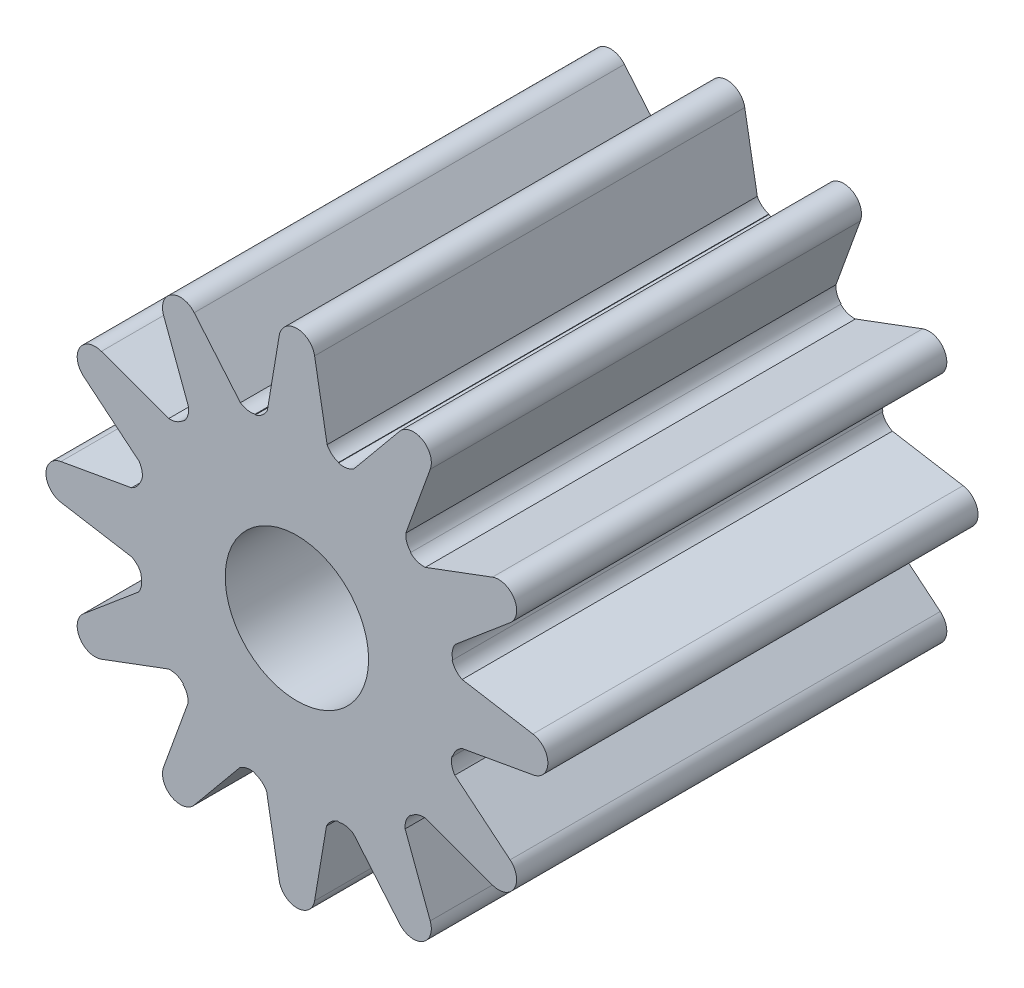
ISO-10303-21;
HEADER;
FILE_DESCRIPTION(('STEP AP214'),'2;1');
FILE_NAME('part.step','',(''),(''),'','','');
FILE_SCHEMA(('AUTOMOTIVE_DESIGN { 1 0 10303 214 1 1 1 1 }'));
ENDSEC;
DATA;
#1=APPLICATION_CONTEXT('core data for automotive mechanical design processes');
#2=APPLICATION_PROTOCOL_DEFINITION('international standard','automotive_design',2000,#1);
#3=PRODUCT_CONTEXT('',#1,'mechanical');
#4=PRODUCT('Part','Part','',(#3));
#5=PRODUCT_RELATED_PRODUCT_CATEGORY('part','',(#4));
#6=PRODUCT_DEFINITION_FORMATION('','',#4);
#7=PRODUCT_DEFINITION_CONTEXT('part definition',#1,'design');
#8=PRODUCT_DEFINITION('design','',#6,#7);
#9=PRODUCT_DEFINITION_SHAPE('','',#8);
#10=(LENGTH_UNIT() NAMED_UNIT(*) SI_UNIT(.MILLI.,.METRE.));
#11=(NAMED_UNIT(*) PLANE_ANGLE_UNIT() SI_UNIT($,.RADIAN.));
#12=(NAMED_UNIT(*) SI_UNIT($,.STERADIAN.) SOLID_ANGLE_UNIT());
#13=UNCERTAINTY_MEASURE_WITH_UNIT(LENGTH_MEASURE(1.E-05),#10,'distance_accuracy_value','');
#14=(GEOMETRIC_REPRESENTATION_CONTEXT(3) GLOBAL_UNCERTAINTY_ASSIGNED_CONTEXT((#13)) GLOBAL_UNIT_ASSIGNED_CONTEXT((#10,
#11,#12)) REPRESENTATION_CONTEXT('',''));
#15=CARTESIAN_POINT('',(0.,0.,0.));
#16=DIRECTION('',(0.,0.,1.));
#17=DIRECTION('',(1.,0.,0.));
#18=AXIS2_PLACEMENT_3D('',#15,#16,#17);
#19=CARTESIAN_POINT('',(0.,0.,-6.));
#20=DIRECTION('',(0.,0.,1.));
#21=DIRECTION('',(1.,0.,0.));
#22=AXIS2_PLACEMENT_3D('',#19,#20,#21);
#23=CYLINDRICAL_SURFACE('',#22,1.);
#24=CARTESIAN_POINT('',(0.,0.,0.));
#25=DIRECTION('',(0.,0.,-1.));
#26=DIRECTION('',(1.,0.,0.));
#27=AXIS2_PLACEMENT_3D('',#24,#25,#26);
#28=CIRCLE('',#27,1.);
#29=CARTESIAN_POINT('',(1.,0.,0.));
#30=VERTEX_POINT('',#29);
#31=EDGE_CURVE('E1318',#30,#30,#28,.T.);
#32=ORIENTED_EDGE('',*,*,#31,.F.);
#33=EDGE_LOOP('',(#32));
#34=FACE_BOUND('',#33,.T.);
#35=CARTESIAN_POINT('',(0.,0.,-6.));
#36=DIRECTION('',(0.,0.,-1.));
#37=DIRECTION('',(1.,0.,0.));
#38=AXIS2_PLACEMENT_3D('',#35,#36,#37);
#39=CIRCLE('',#38,1.);
#40=CARTESIAN_POINT('',(1.,0.,-6.));
#41=VERTEX_POINT('',#40);
#42=EDGE_CURVE('E1345',#41,#41,#39,.T.);
#43=ORIENTED_EDGE('',*,*,#42,.T.);
#44=EDGE_LOOP('',(#43));
#45=FACE_BOUND('',#44,.T.);
#46=ADVANCED_FACE('F350',(#34,#45),#23,.F.);
#47=CARTESIAN_POINT('',(-0.647047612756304,2.41481456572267,-6.));
#48=DIRECTION('',(0.,0.,1.));
#49=DIRECTION('',(1.,0.,0.));
#50=AXIS2_PLACEMENT_3D('',#47,#48,#49);
#51=CYLINDRICAL_SURFACE('',#50,0.259426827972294);
#52=CARTESIAN_POINT('',(-0.647047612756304,2.41481456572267,0.));
#53=DIRECTION('',(0.,0.,-1.));
#54=DIRECTION('',(1.,0.,0.));
#55=AXIS2_PLACEMENT_3D('',#52,#53,#54);
#56=CIRCLE('',#55,0.259426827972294);
#57=CARTESIAN_POINT('',(-0.411952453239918,2.30512160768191,0.));
#58=VERTEX_POINT('',#57);
#59=CARTESIAN_POINT('',(-0.579903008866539,2.16422749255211,0.));
#60=VERTEX_POINT('',#59);
#61=EDGE_CURVE('E790',#58,#60,#56,.T.);
#62=ORIENTED_EDGE('',*,*,#61,.F.);
#63=DIRECTION('',(0.,0.,1.));
#64=VECTOR('',#63,1.);
#65=CARTESIAN_POINT('',(-0.411952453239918,2.30512160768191,-6.));
#66=LINE('',#65,#64);
#67=CARTESIAN_POINT('',(-0.411952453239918,2.30512160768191,-6.));
#68=VERTEX_POINT('',#67);
#69=EDGE_CURVE('E358',#68,#58,#66,.T.);
#70=ORIENTED_EDGE('',*,*,#69,.F.);
#71=CARTESIAN_POINT('',(-0.647047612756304,2.41481456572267,-6.));
#72=DIRECTION('',(0.,0.,-1.));
#73=DIRECTION('',(1.,0.,0.));
#74=AXIS2_PLACEMENT_3D('',#71,#72,#73);
#75=CIRCLE('',#74,0.259426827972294);
#76=CARTESIAN_POINT('',(-0.579903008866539,2.16422749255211,-6.));
#77=VERTEX_POINT('',#76);
#78=EDGE_CURVE('E1362',#68,#77,#75,.T.);
#79=ORIENTED_EDGE('',*,*,#78,.T.);
#80=DIRECTION('',(0.,0.,1.));
#81=VECTOR('',#80,1.);
#82=CARTESIAN_POINT('',(-0.579903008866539,2.16422749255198,-6.));
#83=LINE('',#82,#81);
#84=EDGE_CURVE('E11',#77,#60,#83,.T.);
#85=ORIENTED_EDGE('',*,*,#84,.T.);
#86=EDGE_LOOP('',(#62,#70,#79,#85));
#87=FACE_BOUND('',#86,.T.);
#88=ADVANCED_FACE('F1392',(#87),#51,.F.);
#89=CARTESIAN_POINT('',(-0.246556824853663,3.29134890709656,-6.));
#90=DIRECTION('',(-0.986227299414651,0.165395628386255,0.));
#91=DIRECTION('',(-0.165395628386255,-0.986227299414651,0.));
#92=AXIS2_PLACEMENT_3D('',#89,#90,#91);
#93=PLANE('',#92);
#94=DIRECTION('',(-0.165395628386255,-0.986227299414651,0.));
#95=VECTOR('',#94,1.);
#96=CARTESIAN_POINT('',(-0.246556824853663,3.29134890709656,0.));
#97=LINE('',#96,#95);
#98=CARTESIAN_POINT('',(-0.246556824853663,3.29134890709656,0.));
#99=VERTEX_POINT('',#98);
#100=EDGE_CURVE('E1342',#99,#58,#97,.T.);
#101=ORIENTED_EDGE('',*,*,#100,.F.);
#102=DIRECTION('',(0.,0.,1.));
#103=VECTOR('',#102,1.);
#104=CARTESIAN_POINT('',(-0.246556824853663,3.29134890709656,-6.));
#105=LINE('',#104,#103);
#106=CARTESIAN_POINT('',(-0.246556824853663,3.29134890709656,-6.));
#107=VERTEX_POINT('',#106);
#108=EDGE_CURVE('E1365',#107,#99,#105,.T.);
#109=ORIENTED_EDGE('',*,*,#108,.F.);
#110=DIRECTION('',(-0.165395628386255,-0.986227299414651,0.));
#111=VECTOR('',#110,1.);
#112=CARTESIAN_POINT('',(-0.246556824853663,3.29134890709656,-6.));
#113=LINE('',#112,#111);
#114=EDGE_CURVE('E1359',#107,#68,#113,.T.);
#115=ORIENTED_EDGE('',*,*,#114,.T.);
#116=ORIENTED_EDGE('',*,*,#69,.T.);
#117=EDGE_LOOP('',(#101,#109,#115,#116));
#118=FACE_BOUND('',#117,.T.);
#119=ADVANCED_FACE('F1391',(#118),#93,.T.);
#120=CARTESIAN_POINT('',(0.,3.25,-6.));
#121=DIRECTION('',(0.,0.,1.));
#122=DIRECTION('',(1.,0.,0.));
#123=AXIS2_PLACEMENT_3D('',#120,#121,#122);
#124=CYLINDRICAL_SURFACE('',#123,0.25);
#125=CARTESIAN_POINT('',(0.,3.25,0.));
#126=DIRECTION('',(0.,0.,1.));
#127=DIRECTION('',(1.,0.,0.));
#128=AXIS2_PLACEMENT_3D('',#125,#126,#127);
#129=CIRCLE('',#128,0.25);
#130=CARTESIAN_POINT('',(0.246556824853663,3.29134890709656,0.));
#131=VERTEX_POINT('',#130);
#132=EDGE_CURVE('E1339',#131,#99,#129,.T.);
#133=ORIENTED_EDGE('',*,*,#132,.F.);
#134=DIRECTION('',(0.,0.,1.));
#135=VECTOR('',#134,1.);
#136=CARTESIAN_POINT('',(0.246556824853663,3.29134890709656,-6.));
#137=LINE('',#136,#135);
#138=CARTESIAN_POINT('',(0.246556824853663,3.29134890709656,-6.));
#139=VERTEX_POINT('',#138);
#140=EDGE_CURVE('E1367',#139,#131,#137,.T.);
#141=ORIENTED_EDGE('',*,*,#140,.F.);
#142=CARTESIAN_POINT('',(0.,3.25,-6.));
#143=DIRECTION('',(0.,0.,1.));
#144=DIRECTION('',(1.,0.,0.));
#145=AXIS2_PLACEMENT_3D('',#142,#143,#144);
#146=CIRCLE('',#145,0.25);
#147=EDGE_CURVE('E1356',#139,#107,#146,.T.);
#148=ORIENTED_EDGE('',*,*,#147,.T.);
#149=ORIENTED_EDGE('',*,*,#108,.T.);
#150=EDGE_LOOP('',(#133,#141,#148,#149));
#151=FACE_BOUND('',#150,.T.);
#152=ADVANCED_FACE('F1387',(#151),#124,.T.);
#153=CARTESIAN_POINT('',(0.246556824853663,3.29134890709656,-6.));
#154=DIRECTION('',(0.984562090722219,0.175035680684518,0.));
#155=DIRECTION('',(-0.175035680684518,0.984562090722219,0.));
#156=AXIS2_PLACEMENT_3D('',#153,#154,#155);
#157=PLANE('',#156);
#158=DIRECTION('',(-0.175035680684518,0.984562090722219,0.));
#159=VECTOR('',#158,1.);
#160=CARTESIAN_POINT('',(0.246556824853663,3.29134890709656,0.));
#161=LINE('',#160,#159);
#162=CARTESIAN_POINT('',(0.421592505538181,2.30678681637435,0.));
#163=VERTEX_POINT('',#162);
#164=EDGE_CURVE('E1336',#163,#131,#161,.T.);
#165=ORIENTED_EDGE('',*,*,#164,.F.);
#166=DIRECTION('',(0.,0.,1.));
#167=VECTOR('',#166,1.);
#168=CARTESIAN_POINT('',(0.421592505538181,2.30678681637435,-6.));
#169=LINE('',#168,#167);
#170=CARTESIAN_POINT('',(0.421592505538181,2.30678681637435,-6.));
#171=VERTEX_POINT('',#170);
#172=EDGE_CURVE('E1368',#171,#163,#169,.T.);
#173=ORIENTED_EDGE('',*,*,#172,.F.);
#174=DIRECTION('',(-0.175035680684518,0.984562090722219,0.));
#175=VECTOR('',#174,1.);
#176=CARTESIAN_POINT('',(0.246556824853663,3.29134890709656,-6.));
#177=LINE('',#176,#175);
#178=EDGE_CURVE('E1353',#171,#139,#177,.T.);
#179=ORIENTED_EDGE('',*,*,#178,.T.);
#180=ORIENTED_EDGE('',*,*,#140,.T.);
#181=EDGE_LOOP('',(#165,#173,#179,#180));
#182=FACE_BOUND('',#181,.T.);
#183=ADVANCED_FACE('F1383',(#182),#157,.T.);
#184=CARTESIAN_POINT('',(0.647047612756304,2.41481456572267,-6.));
#185=DIRECTION('',(0.,0.,1.));
#186=DIRECTION('',(1.,0.,0.));
#187=AXIS2_PLACEMENT_3D('',#184,#185,#186);
#188=CYLINDRICAL_SURFACE('',#187,0.25);
#189=CARTESIAN_POINT('',(0.647047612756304,2.41481456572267,0.));
#190=DIRECTION('',(0.,0.,-1.));
#191=DIRECTION('',(1.,0.,0.));
#192=AXIS2_PLACEMENT_3D('',#189,#190,#191);
#193=CIRCLE('',#192,0.25);
#194=CARTESIAN_POINT('',(0.582342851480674,2.1733331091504,0.));
#195=VERTEX_POINT('',#194);
#196=EDGE_CURVE('E1333',#195,#163,#193,.T.);
#197=ORIENTED_EDGE('',*,*,#196,.F.);
#198=DIRECTION('',(0.,0.,1.));
#199=VECTOR('',#198,1.);
#200=CARTESIAN_POINT('',(0.582342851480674,2.1733331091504,-6.));
#201=LINE('',#200,#199);
#202=CARTESIAN_POINT('',(0.582342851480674,2.1733331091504,-6.));
#203=VERTEX_POINT('',#202);
#204=EDGE_CURVE('E353',#203,#195,#201,.T.);
#205=ORIENTED_EDGE('',*,*,#204,.F.);
#206=CARTESIAN_POINT('',(0.647047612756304,2.41481456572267,-6.));
#207=DIRECTION('',(0.,0.,-1.));
#208=DIRECTION('',(1.,0.,0.));
#209=AXIS2_PLACEMENT_3D('',#206,#207,#208);
#210=CIRCLE('',#209,0.25);
#211=EDGE_CURVE('E1350',#203,#171,#210,.T.);
#212=ORIENTED_EDGE('',*,*,#211,.T.);
#213=ORIENTED_EDGE('',*,*,#172,.T.);
#214=EDGE_LOOP('',(#197,#205,#212,#213));
#215=FACE_BOUND('',#214,.T.);
#216=ADVANCED_FACE('F1380',(#215),#188,.F.);
#217=CARTESIAN_POINT('',(0.582342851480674,2.1733331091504,-6.));
#218=DIRECTION('',(0.965925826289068,-0.258819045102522,0.));
#219=DIRECTION('',(0.258819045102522,0.965925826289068,0.));
#220=AXIS2_PLACEMENT_3D('',#217,#218,#219);
#221=PLANE('',#220);
#222=DIRECTION('',(0.,0.,1.));
#223=VECTOR('',#222,1.);
#224=CARTESIAN_POINT('',(0.579903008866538,2.16422749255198,-6.));
#225=LINE('',#224,#223);
#226=CARTESIAN_POINT('',(0.579903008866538,2.16422749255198,-6.));
#227=VERTEX_POINT('',#226);
#228=CARTESIAN_POINT('',(0.579903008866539,2.16422749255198,0.));
#229=VERTEX_POINT('',#228);
#230=EDGE_CURVE('E1316',#227,#229,#225,.T.);
#231=ORIENTED_EDGE('',*,*,#230,.F.);
#232=DIRECTION('',(0.258819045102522,0.965925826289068,0.));
#233=VECTOR('',#232,1.);
#234=CARTESIAN_POINT('',(0.582342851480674,2.1733331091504,-6.));
#235=LINE('',#234,#233);
#236=EDGE_CURVE('E1348',#227,#203,#235,.T.);
#237=ORIENTED_EDGE('',*,*,#236,.T.);
#238=ORIENTED_EDGE('',*,*,#204,.T.);
#239=DIRECTION('',(0.258819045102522,0.965925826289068,0.));
#240=VECTOR('',#239,1.);
#241=CARTESIAN_POINT('',(0.582342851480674,2.1733331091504,0.));
#242=LINE('',#241,#240);
#243=EDGE_CURVE('E1331',#229,#195,#242,.T.);
#244=ORIENTED_EDGE('',*,*,#243,.F.);
#245=EDGE_LOOP('',(#231,#237,#238,#244));
#246=FACE_BOUND('',#245,.T.);
#247=ADVANCED_FACE('F1377',(#246),#221,.T.);
#248=CARTESIAN_POINT('',(0.,0.,-6.));
#249=DIRECTION('',(0.,0.,1.));
#250=DIRECTION('',(1.,0.,0.));
#251=AXIS2_PLACEMENT_3D('',#248,#249,#250);
#252=PLANE('',#251);
#253=ORIENTED_EDGE('',*,*,#236,.F.);
#254=CARTESIAN_POINT('',(0.647047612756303,2.41481456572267,-6.));
#255=DIRECTION('',(0.,0.,-1.));
#256=DIRECTION('',(0.866025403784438,-0.500000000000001,0.));
#257=AXIS2_PLACEMENT_3D('',#254,#255,#256);
#258=CIRCLE('',#257,0.259426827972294);
#259=CARTESIAN_POINT('',(0.795799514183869,2.20227009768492,-6.));
#260=VERTEX_POINT('',#259);
#261=EDGE_CURVE('E1313',#260,#227,#258,.T.);
#262=ORIENTED_EDGE('',*,*,#261,.F.);
#263=DIRECTION('',(-0.636350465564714,-0.771400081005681,0.));
#264=VECTOR('',#263,1.);
#265=CARTESIAN_POINT('',(1.43214997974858,2.9736701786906,-6.));
#266=LINE('',#265,#264);
#267=CARTESIAN_POINT('',(1.43214997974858,2.9736701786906,-6.));
#268=VERTEX_POINT('',#267);
#269=EDGE_CURVE('E1310',#268,#260,#266,.T.);
#270=ORIENTED_EDGE('',*,*,#269,.F.);
#271=CARTESIAN_POINT('',(1.625,2.81458256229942,-6.));
#272=DIRECTION('',(0.,0.,1.));
#273=DIRECTION('',(0.866025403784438,-0.500000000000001,0.));
#274=AXIS2_PLACEMENT_3D('',#271,#272,#273);
#275=CIRCLE('',#274,0.25);
#276=CARTESIAN_POINT('',(1.85919892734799,2.72711335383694,-6.));
#277=VERTEX_POINT('',#276);
#278=EDGE_CURVE('E1307',#277,#268,#275,.T.);
#279=ORIENTED_EDGE('',*,*,#278,.F.);
#280=DIRECTION('',(0.340695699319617,0.94017362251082,0.));
#281=VECTOR('',#280,1.);
#282=CARTESIAN_POINT('',(1.85919892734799,2.72711335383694,-6.));
#283=LINE('',#282,#281);
#284=CARTESIAN_POINT('',(1.51850322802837,1.78693973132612,-6.));
#285=VERTEX_POINT('',#284);
#286=EDGE_CURVE('E1304',#285,#277,#283,.T.);
#287=ORIENTED_EDGE('',*,*,#286,.F.);
#288=CARTESIAN_POINT('',(1.76776695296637,1.76776695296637,-6.));
#289=DIRECTION('',(0.,0.,-1.));
#290=DIRECTION('',(0.866025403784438,-0.500000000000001,0.));
#291=AXIS2_PLACEMENT_3D('',#288,#289,#290);
#292=CIRCLE('',#291,0.25);
#293=CARTESIAN_POINT('',(1.59099025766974,1.59099025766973,-6.));
#294=VERTEX_POINT('',#293);
#295=EDGE_CURVE('E1301',#294,#285,#292,.T.);
#296=ORIENTED_EDGE('',*,*,#295,.F.);
#297=DIRECTION('',(0.707106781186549,0.707106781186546,0.));
#298=VECTOR('',#297,1.);
#299=CARTESIAN_POINT('',(1.59099025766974,1.59099025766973,-6.));
#300=LINE('',#299,#298);
#301=CARTESIAN_POINT('',(1.58432448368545,1.58432448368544,-6.));
#302=VERTEX_POINT('',#301);
#303=EDGE_CURVE('E1299',#302,#294,#300,.T.);
#304=ORIENTED_EDGE('',*,*,#303,.F.);
#305=CARTESIAN_POINT('',(1.76776695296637,1.76776695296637,-6.));
#306=DIRECTION('',(0.,0.,-1.));
#307=DIRECTION('',(0.499999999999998,-0.86602540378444,0.));
#308=AXIS2_PLACEMENT_3D('',#305,#306,#307);
#309=CIRCLE('',#308,0.259426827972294);
#310=CARTESIAN_POINT('',(1.79031764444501,1.50932209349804,-6.));
#311=VERTEX_POINT('',#310);
#312=EDGE_CURVE('E1269',#311,#302,#309,.T.);
#313=ORIENTED_EDGE('',*,*,#312,.F.);
#314=DIRECTION('',(-0.936795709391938,-0.349876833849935,0.));
#315=VECTOR('',#314,1.);
#316=CARTESIAN_POINT('',(2.72711335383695,1.85919892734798,-6.));
#317=LINE('',#316,#315);
#318=CARTESIAN_POINT('',(2.72711335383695,1.85919892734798,-6.));
#319=VERTEX_POINT('',#318);
#320=EDGE_CURVE('E1266',#319,#311,#317,.T.);
#321=ORIENTED_EDGE('',*,*,#320,.F.);
#322=CARTESIAN_POINT('',(2.81458256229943,1.62499999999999,-6.));
#323=DIRECTION('',(0.,0.,1.));
#324=DIRECTION('',(0.499999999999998,-0.86602540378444,0.));
#325=AXIS2_PLACEMENT_3D('',#322,#323,#324);
#326=CIRCLE('',#325,0.25);
#327=CARTESIAN_POINT('',(2.97367017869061,1.43214997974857,-6.));
#328=VERTEX_POINT('',#327);
#329=EDGE_CURVE('E1263',#328,#319,#326,.T.);
#330=ORIENTED_EDGE('',*,*,#329,.F.);
#331=DIRECTION('',(0.765137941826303,0.643866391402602,0.));
#332=VECTOR('',#331,1.);
#333=CARTESIAN_POINT('',(2.97367017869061,1.43214997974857,-6.));
#334=LINE('',#333,#332);
#335=CARTESIAN_POINT('',(2.2085322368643,0.788283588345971,-6.));
#336=VERTEX_POINT('',#335);
#337=EDGE_CURVE('E1260',#336,#328,#334,.T.);
#338=ORIENTED_EDGE('',*,*,#337,.F.);
#339=CARTESIAN_POINT('',(2.41481456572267,0.647047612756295,-6.));
#340=DIRECTION('',(0.,0.,-1.));
#341=DIRECTION('',(0.499999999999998,-0.86602540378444,0.));
#342=AXIS2_PLACEMENT_3D('',#339,#340,#341);
#343=CIRCLE('',#342,0.25);
#344=CARTESIAN_POINT('',(2.17333310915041,0.582342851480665,-6.));
#345=VERTEX_POINT('',#344);
#346=EDGE_CURVE('E1257',#345,#336,#343,.T.);
#347=ORIENTED_EDGE('',*,*,#346,.F.);
#348=DIRECTION('',(0.965925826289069,0.258819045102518,0.));
#349=VECTOR('',#348,1.);
#350=CARTESIAN_POINT('',(2.17333310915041,0.582342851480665,-6.));
#351=LINE('',#350,#349);
#352=CARTESIAN_POINT('',(2.16422749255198,0.579903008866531,-6.));
#353=VERTEX_POINT('',#352);
#354=EDGE_CURVE('E1255',#353,#345,#351,.T.);
#355=ORIENTED_EDGE('',*,*,#354,.F.);
#356=CARTESIAN_POINT('',(2.41481456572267,0.647047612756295,-6.));
#357=DIRECTION('',(0.,0.,-1.));
#358=DIRECTION('',(0.,-1.,0.));
#359=AXIS2_PLACEMENT_3D('',#356,#357,#358);
#360=CIRCLE('',#359,0.259426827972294);
#361=CARTESIAN_POINT('',(2.30512160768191,0.41195245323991,-6.));
#362=VERTEX_POINT('',#361);
#363=EDGE_CURVE('E1223',#362,#353,#360,.T.);
#364=ORIENTED_EDGE('',*,*,#363,.F.);
#365=DIRECTION('',(-0.98622729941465,0.165395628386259,0.));
#366=VECTOR('',#365,1.);
#367=CARTESIAN_POINT('',(3.29134890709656,0.246556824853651,-6.));
#368=LINE('',#367,#366);
#369=CARTESIAN_POINT('',(3.29134890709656,0.246556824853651,-6.));
#370=VERTEX_POINT('',#369);
#371=EDGE_CURVE('E1220',#370,#362,#368,.T.);
#372=ORIENTED_EDGE('',*,*,#371,.F.);
#373=CARTESIAN_POINT('',(3.25,0.,-6.));
#374=DIRECTION('',(0.,0.,1.));
#375=DIRECTION('',(0.,-1.,0.));
#376=AXIS2_PLACEMENT_3D('',#373,#374,#375);
#377=CIRCLE('',#376,0.25);
#378=CARTESIAN_POINT('',(3.29134890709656,-0.246556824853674,-6.));
#379=VERTEX_POINT('',#378);
#380=EDGE_CURVE('E1217',#379,#370,#377,.T.);
#381=ORIENTED_EDGE('',*,*,#380,.F.);
#382=DIRECTION('',(0.98456209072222,0.175035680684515,0.));
#383=VECTOR('',#382,1.);
#384=CARTESIAN_POINT('',(3.29134890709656,-0.246556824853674,-6.));
#385=LINE('',#384,#383);
#386=CARTESIAN_POINT('',(2.30678681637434,-0.421592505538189,-6.));
#387=VERTEX_POINT('',#386);
#388=EDGE_CURVE('E1214',#387,#379,#385,.T.);
#389=ORIENTED_EDGE('',*,*,#388,.F.);
#390=CARTESIAN_POINT('',(2.41481456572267,-0.647047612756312,-6.));
#391=DIRECTION('',(0.,0.,-1.));
#392=DIRECTION('',(0.,-1.,0.));
#393=AXIS2_PLACEMENT_3D('',#390,#391,#392);
#394=CIRCLE('',#393,0.25);
#395=CARTESIAN_POINT('',(2.1733331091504,-0.582342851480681,-6.));
#396=VERTEX_POINT('',#395);
#397=EDGE_CURVE('E1211',#396,#387,#394,.T.);
#398=ORIENTED_EDGE('',*,*,#397,.F.);
#399=DIRECTION('',(0.965925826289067,-0.258819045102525,0.));
#400=VECTOR('',#399,1.);
#401=CARTESIAN_POINT('',(2.1733331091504,-0.582342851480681,-6.));
#402=LINE('',#401,#400);
#403=CARTESIAN_POINT('',(2.16422749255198,-0.579903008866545,-6.));
#404=VERTEX_POINT('',#403);
#405=EDGE_CURVE('E1209',#404,#396,#402,.T.);
#406=ORIENTED_EDGE('',*,*,#405,.F.);
#407=CARTESIAN_POINT('',(2.41481456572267,-0.647047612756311,-6.));
#408=DIRECTION('',(0.,0.,-1.));
#409=DIRECTION('',(-0.500000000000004,-0.866025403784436,0.));
#410=AXIS2_PLACEMENT_3D('',#407,#408,#409);
#411=CIRCLE('',#410,0.259426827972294);
#412=CARTESIAN_POINT('',(2.20227009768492,-0.795799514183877,-6.));
#413=VERTEX_POINT('',#412);
#414=EDGE_CURVE('E1177',#413,#404,#411,.T.);
#415=ORIENTED_EDGE('',*,*,#414,.F.);
#416=DIRECTION('',(-0.771400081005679,0.636350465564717,0.));
#417=VECTOR('',#416,1.);
#418=CARTESIAN_POINT('',(2.9736701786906,-1.43214997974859,-6.));
#419=LINE('',#418,#417);
#420=CARTESIAN_POINT('',(2.9736701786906,-1.43214997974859,-6.));
#421=VERTEX_POINT('',#420);
#422=EDGE_CURVE('E1174',#421,#413,#419,.T.);
#423=ORIENTED_EDGE('',*,*,#422,.F.);
#424=CARTESIAN_POINT('',(2.81458256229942,-1.62500000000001,-6.));
#425=DIRECTION('',(0.,0.,1.));
#426=DIRECTION('',(-0.500000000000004,-0.866025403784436,0.));
#427=AXIS2_PLACEMENT_3D('',#424,#425,#426);
#428=CIRCLE('',#427,0.25);
#429=CARTESIAN_POINT('',(2.72711335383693,-1.859198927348,-6.));
#430=VERTEX_POINT('',#429);
#431=EDGE_CURVE('E1171',#430,#421,#428,.T.);
#432=ORIENTED_EDGE('',*,*,#431,.F.);
#433=DIRECTION('',(0.940173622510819,-0.34069569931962,0.));
#434=VECTOR('',#433,1.);
#435=CARTESIAN_POINT('',(2.72711335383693,-1.859198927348,-6.));
#436=LINE('',#435,#434);
#437=CARTESIAN_POINT('',(1.78693973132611,-1.51850322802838,-6.));
#438=VERTEX_POINT('',#437);
#439=EDGE_CURVE('E1168',#438,#430,#436,.T.);
#440=ORIENTED_EDGE('',*,*,#439,.F.);
#441=CARTESIAN_POINT('',(1.76776695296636,-1.76776695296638,-6.));
#442=DIRECTION('',(0.,0.,-1.));
#443=DIRECTION('',(-0.500000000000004,-0.866025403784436,0.));
#444=AXIS2_PLACEMENT_3D('',#441,#442,#443);
#445=CIRCLE('',#444,0.25);
#446=CARTESIAN_POINT('',(1.59099025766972,-1.59099025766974,-6.));
#447=VERTEX_POINT('',#446);
#448=EDGE_CURVE('E1165',#447,#438,#445,.T.);
#449=ORIENTED_EDGE('',*,*,#448,.F.);
#450=DIRECTION('',(0.707106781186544,-0.707106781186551,0.));
#451=VECTOR('',#450,1.);
#452=CARTESIAN_POINT('',(1.59099025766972,-1.59099025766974,-6.));
#453=LINE('',#452,#451);
#454=CARTESIAN_POINT('',(1.58432448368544,-1.58432448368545,-6.));
#455=VERTEX_POINT('',#454);
#456=EDGE_CURVE('E1163',#455,#447,#453,.T.);
#457=ORIENTED_EDGE('',*,*,#456,.F.);
#458=CARTESIAN_POINT('',(1.76776695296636,-1.76776695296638,-6.));
#459=DIRECTION('',(0.,0.,-1.));
#460=DIRECTION('',(-0.866025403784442,-0.499999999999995,0.));
#461=AXIS2_PLACEMENT_3D('',#458,#459,#460);
#462=CIRCLE('',#461,0.259426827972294);
#463=CARTESIAN_POINT('',(1.50932209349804,-1.79031764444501,-6.));
#464=VERTEX_POINT('',#463);
#465=EDGE_CURVE('E1131',#464,#455,#462,.T.);
#466=ORIENTED_EDGE('',*,*,#465,.F.);
#467=DIRECTION('',(-0.349876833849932,0.936795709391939,0.));
#468=VECTOR('',#467,1.);
#469=CARTESIAN_POINT('',(1.85919892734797,-2.72711335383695,-6.));
#470=LINE('',#469,#468);
#471=CARTESIAN_POINT('',(1.85919892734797,-2.72711335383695,-6.));
#472=VERTEX_POINT('',#471);
#473=EDGE_CURVE('E1128',#472,#464,#470,.T.);
#474=ORIENTED_EDGE('',*,*,#473,.F.);
#475=CARTESIAN_POINT('',(1.62499999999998,-2.81458256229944,-6.));
#476=DIRECTION('',(0.,0.,1.));
#477=DIRECTION('',(-0.866025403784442,-0.499999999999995,0.));
#478=AXIS2_PLACEMENT_3D('',#475,#476,#477);
#479=CIRCLE('',#478,0.25);
#480=CARTESIAN_POINT('',(1.43214997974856,-2.97367017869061,-6.));
#481=VERTEX_POINT('',#480);
#482=EDGE_CURVE('E1125',#481,#472,#479,.T.);
#483=ORIENTED_EDGE('',*,*,#482,.F.);
#484=DIRECTION('',(0.643866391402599,-0.765137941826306,0.));
#485=VECTOR('',#484,1.);
#486=CARTESIAN_POINT('',(1.43214997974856,-2.97367017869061,-6.));
#487=LINE('',#486,#485);
#488=CARTESIAN_POINT('',(0.788283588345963,-2.20853223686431,-6.));
#489=VERTEX_POINT('',#488);
#490=EDGE_CURVE('E1122',#489,#481,#487,.T.);
#491=ORIENTED_EDGE('',*,*,#490,.F.);
#492=CARTESIAN_POINT('',(0.647047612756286,-2.41481456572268,-6.));
#493=DIRECTION('',(0.,0.,-1.));
#494=DIRECTION('',(-0.866025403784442,-0.499999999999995,0.));
#495=AXIS2_PLACEMENT_3D('',#492,#493,#494);
#496=CIRCLE('',#495,0.25);
#497=CARTESIAN_POINT('',(0.582342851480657,-2.17333310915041,-6.));
#498=VERTEX_POINT('',#497);
#499=EDGE_CURVE('E1119',#498,#489,#496,.T.);
#500=ORIENTED_EDGE('',*,*,#499,.F.);
#501=DIRECTION('',(0.258819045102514,-0.96592582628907,0.));
#502=VECTOR('',#501,1.);
#503=CARTESIAN_POINT('',(0.582342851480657,-2.17333310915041,-6.));
#504=LINE('',#503,#502);
#505=CARTESIAN_POINT('',(0.579903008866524,-2.16422749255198,-6.));
#506=VERTEX_POINT('',#505);
#507=EDGE_CURVE('E1117',#506,#498,#504,.T.);
#508=ORIENTED_EDGE('',*,*,#507,.F.);
#509=CARTESIAN_POINT('',(0.647047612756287,-2.41481456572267,-6.));
#510=DIRECTION('',(0.,0.,-1.));
#511=DIRECTION('',(-1.,0.,0.));
#512=AXIS2_PLACEMENT_3D('',#509,#510,#511);
#513=CIRCLE('',#512,0.259426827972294);
#514=CARTESIAN_POINT('',(0.411952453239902,-2.30512160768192,-6.));
#515=VERTEX_POINT('',#514);
#516=EDGE_CURVE('E1085',#515,#506,#513,.T.);
#517=ORIENTED_EDGE('',*,*,#516,.F.);
#518=DIRECTION('',(0.165395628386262,0.98622729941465,0.));
#519=VECTOR('',#518,1.);
#520=CARTESIAN_POINT('',(0.24655682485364,-3.29134890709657,-6.));
#521=LINE('',#520,#519);
#522=CARTESIAN_POINT('',(0.24655682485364,-3.29134890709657,-6.));
#523=VERTEX_POINT('',#522);
#524=EDGE_CURVE('E1082',#523,#515,#521,.T.);
#525=ORIENTED_EDGE('',*,*,#524,.F.);
#526=CARTESIAN_POINT('',(0.,-3.25,-6.));
#527=DIRECTION('',(0.,0.,1.));
#528=DIRECTION('',(-1.,0.,0.));
#529=AXIS2_PLACEMENT_3D('',#526,#527,#528);
#530=CIRCLE('',#529,0.25);
#531=CARTESIAN_POINT('',(-0.246556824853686,-3.29134890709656,-6.));
#532=VERTEX_POINT('',#531);
#533=EDGE_CURVE('E1079',#532,#523,#530,.T.);
#534=ORIENTED_EDGE('',*,*,#533,.F.);
#535=DIRECTION('',(0.175035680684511,-0.98456209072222,0.));
#536=VECTOR('',#535,1.);
#537=CARTESIAN_POINT('',(-0.246556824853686,-3.29134890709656,-6.));
#538=LINE('',#537,#536);
#539=CARTESIAN_POINT('',(-0.421592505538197,-2.30678681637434,-6.));
#540=VERTEX_POINT('',#539);
#541=EDGE_CURVE('E1076',#540,#532,#538,.T.);
#542=ORIENTED_EDGE('',*,*,#541,.F.);
#543=CARTESIAN_POINT('',(-0.647047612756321,-2.41481456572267,-6.));
#544=DIRECTION('',(0.,0.,-1.));
#545=DIRECTION('',(-1.,0.,0.));
#546=AXIS2_PLACEMENT_3D('',#543,#544,#545);
#547=CIRCLE('',#546,0.25);
#548=CARTESIAN_POINT('',(-0.582342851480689,-2.1733331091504,-6.));
#549=VERTEX_POINT('',#548);
#550=EDGE_CURVE('E1073',#549,#540,#547,.T.);
#551=ORIENTED_EDGE('',*,*,#550,.F.);
#552=DIRECTION('',(-0.258819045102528,-0.965925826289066,0.));
#553=VECTOR('',#552,1.);
#554=CARTESIAN_POINT('',(-0.582342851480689,-2.1733331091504,-6.));
#555=LINE('',#554,#553);
#556=CARTESIAN_POINT('',(-0.579903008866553,-2.16422749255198,-6.));
#557=VERTEX_POINT('',#556);
#558=EDGE_CURVE('E1071',#557,#549,#555,.T.);
#559=ORIENTED_EDGE('',*,*,#558,.F.);
#560=CARTESIAN_POINT('',(-0.64704761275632,-2.41481456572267,-6.));
#561=DIRECTION('',(0.,0.,-1.));
#562=DIRECTION('',(-0.866025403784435,0.500000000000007,0.));
#563=AXIS2_PLACEMENT_3D('',#560,#561,#562);
#564=CIRCLE('',#563,0.259426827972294);
#565=CARTESIAN_POINT('',(-0.795799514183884,-2.20227009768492,-6.));
#566=VERTEX_POINT('',#565);
#567=EDGE_CURVE('E1039',#566,#557,#564,.T.);
#568=ORIENTED_EDGE('',*,*,#567,.F.);
#569=DIRECTION('',(0.63635046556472,0.771400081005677,0.));
#570=VECTOR('',#569,1.);
#571=CARTESIAN_POINT('',(-1.4321499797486,-2.97367017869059,-6.));
#572=LINE('',#571,#570);
#573=CARTESIAN_POINT('',(-1.4321499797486,-2.97367017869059,-6.));
#574=VERTEX_POINT('',#573);
#575=EDGE_CURVE('E1036',#574,#566,#572,.T.);
#576=ORIENTED_EDGE('',*,*,#575,.F.);
#577=CARTESIAN_POINT('',(-1.62500000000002,-2.81458256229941,-6.));
#578=DIRECTION('',(0.,0.,1.));
#579=DIRECTION('',(-0.866025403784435,0.500000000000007,0.));
#580=AXIS2_PLACEMENT_3D('',#577,#578,#579);
#581=CIRCLE('',#580,0.25);
#582=CARTESIAN_POINT('',(-1.85919892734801,-2.72711335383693,-6.));
#583=VERTEX_POINT('',#582);
#584=EDGE_CURVE('E1033',#583,#574,#581,.T.);
#585=ORIENTED_EDGE('',*,*,#584,.F.);
#586=DIRECTION('',(-0.340695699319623,-0.940173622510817,0.));
#587=VECTOR('',#586,1.);
#588=CARTESIAN_POINT('',(-1.85919892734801,-2.72711335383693,-6.));
#589=LINE('',#588,#587);
#590=CARTESIAN_POINT('',(-1.51850322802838,-1.78693973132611,-6.));
#591=VERTEX_POINT('',#590);
#592=EDGE_CURVE('E1030',#591,#583,#589,.T.);
#593=ORIENTED_EDGE('',*,*,#592,.F.);
#594=CARTESIAN_POINT('',(-1.76776695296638,-1.76776695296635,-6.));
#595=DIRECTION('',(0.,0.,-1.));
#596=DIRECTION('',(-0.866025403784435,0.500000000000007,0.));
#597=AXIS2_PLACEMENT_3D('',#594,#595,#596);
#598=CIRCLE('',#597,0.25);
#599=CARTESIAN_POINT('',(-1.59099025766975,-1.59099025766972,-6.));
#600=VERTEX_POINT('',#599);
#601=EDGE_CURVE('E1027',#600,#591,#598,.T.);
#602=ORIENTED_EDGE('',*,*,#601,.F.);
#603=DIRECTION('',(-0.707106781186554,-0.707106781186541,0.));
#604=VECTOR('',#603,1.);
#605=CARTESIAN_POINT('',(-1.59099025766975,-1.59099025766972,-6.));
#606=LINE('',#605,#604);
#607=CARTESIAN_POINT('',(-1.58432448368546,-1.58432448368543,-6.));
#608=VERTEX_POINT('',#607);
#609=EDGE_CURVE('E1025',#608,#600,#606,.T.);
#610=ORIENTED_EDGE('',*,*,#609,.F.);
#611=CARTESIAN_POINT('',(-1.76776695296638,-1.76776695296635,-6.));
#612=DIRECTION('',(0.,0.,-1.));
#613=DIRECTION('',(-0.499999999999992,0.866025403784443,0.));
#614=AXIS2_PLACEMENT_3D('',#611,#612,#613);
#615=CIRCLE('',#614,0.259426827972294);
#616=CARTESIAN_POINT('',(-1.79031764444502,-1.50932209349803,-6.));
#617=VERTEX_POINT('',#616);
#618=EDGE_CURVE('E1493',#617,#608,#615,.T.);
#619=ORIENTED_EDGE('',*,*,#618,.F.);
#620=DIRECTION('',(0.93679570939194,0.349876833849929,0.));
#621=VECTOR('',#620,1.);
#622=CARTESIAN_POINT('',(-2.72711335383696,-1.85919892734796,-6.));
#623=LINE('',#622,#621);
#624=CARTESIAN_POINT('',(-2.72711335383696,-1.85919892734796,-6.));
#625=VERTEX_POINT('',#624);
#626=EDGE_CURVE('E1490',#625,#617,#623,.T.);
#627=ORIENTED_EDGE('',*,*,#626,.F.);
#628=CARTESIAN_POINT('',(-2.81458256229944,-1.62499999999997,-6.));
#629=DIRECTION('',(0.,0.,1.));
#630=DIRECTION('',(-0.499999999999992,0.866025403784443,0.));
#631=AXIS2_PLACEMENT_3D('',#628,#629,#630);
#632=CIRCLE('',#631,0.25);
#633=CARTESIAN_POINT('',(-2.97367017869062,-1.43214997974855,-6.));
#634=VERTEX_POINT('',#633);
#635=EDGE_CURVE('E1487',#634,#625,#632,.T.);
#636=ORIENTED_EDGE('',*,*,#635,.F.);
#637=DIRECTION('',(-0.765137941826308,-0.643866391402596,0.));
#638=VECTOR('',#637,1.);
#639=CARTESIAN_POINT('',(-2.97367017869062,-1.43214997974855,-6.));
#640=LINE('',#639,#638);
#641=CARTESIAN_POINT('',(-2.20853223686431,-0.788283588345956,-6.));
#642=VERTEX_POINT('',#641);
#643=EDGE_CURVE('E999',#642,#634,#640,.T.);
#644=ORIENTED_EDGE('',*,*,#643,.F.);
#645=CARTESIAN_POINT('',(-2.41481456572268,-0.647047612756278,-6.));
#646=DIRECTION('',(0.,0.,-1.));
#647=DIRECTION('',(-0.499999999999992,0.866025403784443,0.));
#648=AXIS2_PLACEMENT_3D('',#645,#646,#647);
#649=CIRCLE('',#648,0.25);
#650=CARTESIAN_POINT('',(-2.1687803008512,-0.581122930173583,-6.));
#651=VERTEX_POINT('',#650);
#652=EDGE_CURVE('E991',#651,#642,#649,.T.);
#653=ORIENTED_EDGE('',*,*,#652,.F.);
#654=CARTESIAN_POINT('',(-2.41481456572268,-0.647047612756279,-6.));
#655=DIRECTION('',(0.,0.,-1.));
#656=DIRECTION('',(0.,1.,0.));
#657=AXIS2_PLACEMENT_3D('',#654,#655,#656);
#658=CIRCLE('',#657,0.259426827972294);
#659=CARTESIAN_POINT('',(-2.30512160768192,-0.411952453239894,-6.));
#660=VERTEX_POINT('',#659);
#661=EDGE_CURVE('E929',#660,#651,#658,.T.);
#662=ORIENTED_EDGE('',*,*,#661,.F.);
#663=DIRECTION('',(0.986227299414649,-0.165395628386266,0.));
#664=VECTOR('',#663,1.);
#665=CARTESIAN_POINT('',(-3.29134890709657,-0.246556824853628,-6.));
#666=LINE('',#665,#664);
#667=CARTESIAN_POINT('',(-3.29134890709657,-0.246556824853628,-6.));
#668=VERTEX_POINT('',#667);
#669=EDGE_CURVE('E926',#668,#660,#666,.T.);
#670=ORIENTED_EDGE('',*,*,#669,.F.);
#671=CARTESIAN_POINT('',(-3.25,0.,-6.));
#672=DIRECTION('',(0.,0.,1.));
#673=DIRECTION('',(0.,1.,0.));
#674=AXIS2_PLACEMENT_3D('',#671,#672,#673);
#675=CIRCLE('',#674,0.25);
#676=CARTESIAN_POINT('',(-3.29134890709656,0.246556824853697,-6.));
#677=VERTEX_POINT('',#676);
#678=EDGE_CURVE('E922',#677,#668,#675,.T.);
#679=ORIENTED_EDGE('',*,*,#678,.F.);
#680=DIRECTION('',(-0.984562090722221,-0.175035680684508,0.));
#681=VECTOR('',#680,1.);
#682=CARTESIAN_POINT('',(-3.29134890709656,0.246556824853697,-6.));
#683=LINE('',#682,#681);
#684=CARTESIAN_POINT('',(-2.30678681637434,0.421592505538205,-6.));
#685=VERTEX_POINT('',#684);
#686=EDGE_CURVE('E919',#685,#677,#683,.T.);
#687=ORIENTED_EDGE('',*,*,#686,.F.);
#688=CARTESIAN_POINT('',(-2.41481456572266,0.647047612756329,-6.));
#689=DIRECTION('',(0.,0.,-1.));
#690=DIRECTION('',(0.,1.,0.));
#691=AXIS2_PLACEMENT_3D('',#688,#689,#690);
#692=CIRCLE('',#691,0.25);
#693=CARTESIAN_POINT('',(-2.16878030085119,0.581122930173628,-6.));
#694=VERTEX_POINT('',#693);
#695=EDGE_CURVE('E923',#694,#685,#692,.T.);
#696=ORIENTED_EDGE('',*,*,#695,.F.);
#697=CARTESIAN_POINT('',(-2.41481456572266,0.647047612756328,-6.));
#698=DIRECTION('',(0.,0.,-1.));
#699=DIRECTION('',(0.50000000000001,0.866025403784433,0.));
#700=AXIS2_PLACEMENT_3D('',#697,#698,#699);
#701=CIRCLE('',#700,0.259426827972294);
#702=CARTESIAN_POINT('',(-2.20227009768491,0.795799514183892,-6.));
#703=VERTEX_POINT('',#702);
#704=EDGE_CURVE('E890',#703,#694,#701,.T.);
#705=ORIENTED_EDGE('',*,*,#704,.F.);
#706=DIRECTION('',(0.771400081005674,-0.636350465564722,0.));
#707=VECTOR('',#706,1.);
#708=CARTESIAN_POINT('',(-2.97367017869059,1.43214997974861,-6.));
#709=LINE('',#708,#707);
#710=CARTESIAN_POINT('',(-2.97367017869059,1.43214997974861,-6.));
#711=VERTEX_POINT('',#710);
#712=EDGE_CURVE('E898',#711,#703,#709,.T.);
#713=ORIENTED_EDGE('',*,*,#712,.F.);
#714=CARTESIAN_POINT('',(-2.81458256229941,1.62500000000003,-6.));
#715=DIRECTION('',(0.,0.,1.));
#716=DIRECTION('',(0.50000000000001,0.866025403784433,0.));
#717=AXIS2_PLACEMENT_3D('',#714,#715,#716);
#718=CIRCLE('',#717,0.25);
#719=CARTESIAN_POINT('',(-2.72711335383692,1.85919892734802,-6.));
#720=VERTEX_POINT('',#719);
#721=EDGE_CURVE('E1419',#720,#711,#718,.T.);
#722=ORIENTED_EDGE('',*,*,#721,.F.);
#723=DIRECTION('',(-0.940173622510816,0.340695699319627,0.));
#724=VECTOR('',#723,1.);
#725=CARTESIAN_POINT('',(-2.72711335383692,1.85919892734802,-6.));
#726=LINE('',#725,#724);
#727=CARTESIAN_POINT('',(-1.7869397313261,1.51850322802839,-6.));
#728=VERTEX_POINT('',#727);
#729=EDGE_CURVE('E1416',#728,#720,#726,.T.);
#730=ORIENTED_EDGE('',*,*,#729,.F.);
#731=CARTESIAN_POINT('',(-1.76776695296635,1.76776695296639,-6.));
#732=DIRECTION('',(0.,0.,-1.));
#733=DIRECTION('',(0.50000000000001,0.866025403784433,0.));
#734=AXIS2_PLACEMENT_3D('',#731,#732,#733);
#735=CIRCLE('',#734,0.25);
#736=CARTESIAN_POINT('',(-1.58765737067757,1.58765737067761,-6.));
#737=VERTEX_POINT('',#736);
#738=EDGE_CURVE('E904',#737,#728,#735,.T.);
#739=ORIENTED_EDGE('',*,*,#738,.F.);
#740=CARTESIAN_POINT('',(-1.76776695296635,1.76776695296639,-6.));
#741=DIRECTION('',(0.,0.,-1.));
#742=DIRECTION('',(0.866025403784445,0.499999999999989,0.));
#743=AXIS2_PLACEMENT_3D('',#740,#741,#742);
#744=CIRCLE('',#743,0.259426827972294);
#745=CARTESIAN_POINT('',(-1.50932209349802,1.79031764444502,-6.));
#746=VERTEX_POINT('',#745);
#747=EDGE_CURVE('E802',#746,#737,#744,.T.);
#748=ORIENTED_EDGE('',*,*,#747,.F.);
#749=DIRECTION('',(0.349876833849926,-0.936795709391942,0.));
#750=VECTOR('',#749,1.);
#751=CARTESIAN_POINT('',(-1.85919892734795,2.72711335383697,-6.));
#752=LINE('',#751,#750);
#753=CARTESIAN_POINT('',(-1.85919892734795,2.72711335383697,-6.));
#754=VERTEX_POINT('',#753);
#755=EDGE_CURVE('E826',#754,#746,#752,.T.);
#756=ORIENTED_EDGE('',*,*,#755,.F.);
#757=CARTESIAN_POINT('',(-1.62499999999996,2.81458256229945,-6.));
#758=DIRECTION('',(0.,0.,1.));
#759=DIRECTION('',(0.866025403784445,0.499999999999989,0.));
#760=AXIS2_PLACEMENT_3D('',#757,#758,#759);
#761=CIRCLE('',#760,0.25);
#762=CARTESIAN_POINT('',(-1.43214997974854,2.97367017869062,-6.));
#763=VERTEX_POINT('',#762);
#764=EDGE_CURVE('E823',#763,#754,#761,.T.);
#765=ORIENTED_EDGE('',*,*,#764,.F.);
#766=DIRECTION('',(-0.643866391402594,0.76513794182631,0.));
#767=VECTOR('',#766,1.);
#768=CARTESIAN_POINT('',(-1.43214997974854,2.97367017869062,-6.));
#769=LINE('',#768,#767);
#770=CARTESIAN_POINT('',(-0.788283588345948,2.20853223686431,-6.));
#771=VERTEX_POINT('',#770);
#772=EDGE_CURVE('E820',#771,#763,#769,.T.);
#773=ORIENTED_EDGE('',*,*,#772,.F.);
#774=CARTESIAN_POINT('',(-0.647047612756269,2.41481456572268,-6.));
#775=DIRECTION('',(0.,0.,-1.));
#776=DIRECTION('',(0.866025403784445,0.499999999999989,0.));
#777=AXIS2_PLACEMENT_3D('',#774,#775,#776);
#778=CIRCLE('',#777,0.25);
#779=CARTESIAN_POINT('',(-0.582342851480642,2.17333310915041,-6.));
#780=VERTEX_POINT('',#779);
#781=EDGE_CURVE('E818',#780,#771,#778,.T.);
#782=ORIENTED_EDGE('',*,*,#781,.F.);
#783=DIRECTION('',(-0.258819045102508,0.965925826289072,0.));
#784=VECTOR('',#783,1.);
#785=CARTESIAN_POINT('',(-0.582342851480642,2.17333310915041,-6.));
#786=LINE('',#785,#784);
#787=EDGE_CURVE('E797',#77,#780,#786,.T.);
#788=ORIENTED_EDGE('',*,*,#787,.F.);
#789=ORIENTED_EDGE('',*,*,#78,.F.);
#790=ORIENTED_EDGE('',*,*,#114,.F.);
#791=ORIENTED_EDGE('',*,*,#147,.F.);
#792=ORIENTED_EDGE('',*,*,#178,.F.);
#793=ORIENTED_EDGE('',*,*,#211,.F.);
#794=EDGE_LOOP('',(#253,#262,#270,#279,#287,#296,#304,#313,#321,#330,#338,#347,#355,#364,#372,
#381,#389,#398,#406,#415,#423,#432,#440,#449,#457,#466,#474,#483,#491,#500,#508,#517,#525,#534,
#542,#551,#559,#568,#576,#585,#593,#602,#610,#619,#627,#636,#644,#653,#662,#670,#679,#687,#696,
#705,#713,#722,#730,#739,#748,#756,#765,#773,#782,#788,#789,#790,#791,#792,#793));
#795=FACE_BOUND('',#794,.T.);
#796=ORIENTED_EDGE('',*,*,#42,.F.);
#797=EDGE_LOOP('',(#796));
#798=FACE_BOUND('',#797,.T.);
#799=ADVANCED_FACE('F1394',(#795,#798),#252,.F.);
#800=CARTESIAN_POINT('',(0.,0.,0.));
#801=DIRECTION('',(0.,0.,1.));
#802=DIRECTION('',(1.,0.,0.));
#803=AXIS2_PLACEMENT_3D('',#800,#801,#802);
#804=PLANE('',#803);
#805=CARTESIAN_POINT('',(0.647047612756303,2.41481456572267,0.));
#806=DIRECTION('',(0.,0.,-1.));
#807=DIRECTION('',(0.866025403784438,-0.500000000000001,0.));
#808=AXIS2_PLACEMENT_3D('',#805,#806,#807);
#809=CIRCLE('',#808,0.259426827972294);
#810=CARTESIAN_POINT('',(0.795799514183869,2.20227009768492,0.));
#811=VERTEX_POINT('',#810);
#812=EDGE_CURVE('E366',#811,#229,#809,.T.);
#813=ORIENTED_EDGE('',*,*,#812,.T.);
#814=ORIENTED_EDGE('',*,*,#243,.T.);
#815=ORIENTED_EDGE('',*,*,#196,.T.);
#816=ORIENTED_EDGE('',*,*,#164,.T.);
#817=ORIENTED_EDGE('',*,*,#132,.T.);
#818=ORIENTED_EDGE('',*,*,#100,.T.);
#819=ORIENTED_EDGE('',*,*,#61,.T.);
#820=DIRECTION('',(-0.258819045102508,0.965925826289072,0.));
#821=VECTOR('',#820,1.);
#822=CARTESIAN_POINT('',(-0.582342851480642,2.17333310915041,0.));
#823=LINE('',#822,#821);
#824=CARTESIAN_POINT('',(-0.582342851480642,2.17333310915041,0.));
#825=VERTEX_POINT('',#824);
#826=EDGE_CURVE('E782',#60,#825,#823,.T.);
#827=ORIENTED_EDGE('',*,*,#826,.T.);
#828=CARTESIAN_POINT('',(-0.647047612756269,2.41481456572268,0.));
#829=DIRECTION('',(0.,0.,-1.));
#830=DIRECTION('',(0.866025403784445,0.499999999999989,0.));
#831=AXIS2_PLACEMENT_3D('',#828,#829,#830);
#832=CIRCLE('',#831,0.25);
#833=CARTESIAN_POINT('',(-0.788283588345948,2.20853223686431,0.));
#834=VERTEX_POINT('',#833);
#835=EDGE_CURVE('E788',#825,#834,#832,.T.);
#836=ORIENTED_EDGE('',*,*,#835,.T.);
#837=DIRECTION('',(-0.643866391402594,0.76513794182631,0.));
#838=VECTOR('',#837,1.);
#839=CARTESIAN_POINT('',(-1.43214997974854,2.97367017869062,0.));
#840=LINE('',#839,#838);
#841=CARTESIAN_POINT('',(-1.43214997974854,2.97367017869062,0.));
#842=VERTEX_POINT('',#841);
#843=EDGE_CURVE('E806',#834,#842,#840,.T.);
#844=ORIENTED_EDGE('',*,*,#843,.T.);
#845=CARTESIAN_POINT('',(-1.62499999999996,2.81458256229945,0.));
#846=DIRECTION('',(0.,0.,1.));
#847=DIRECTION('',(0.866025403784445,0.499999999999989,0.));
#848=AXIS2_PLACEMENT_3D('',#845,#846,#847);
#849=CIRCLE('',#848,0.25);
#850=CARTESIAN_POINT('',(-1.85919892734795,2.72711335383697,0.));
#851=VERTEX_POINT('',#850);
#852=EDGE_CURVE('E808',#842,#851,#849,.T.);
#853=ORIENTED_EDGE('',*,*,#852,.T.);
#854=DIRECTION('',(0.349876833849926,-0.936795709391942,0.));
#855=VECTOR('',#854,1.);
#856=CARTESIAN_POINT('',(-1.85919892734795,2.72711335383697,0.));
#857=LINE('',#856,#855);
#858=CARTESIAN_POINT('',(-1.50932209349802,1.79031764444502,0.));
#859=VERTEX_POINT('',#858);
#860=EDGE_CURVE('E813',#851,#859,#857,.T.);
#861=ORIENTED_EDGE('',*,*,#860,.T.);
#862=CARTESIAN_POINT('',(-1.76776695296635,1.76776695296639,0.));
#863=DIRECTION('',(0.,0.,-1.));
#864=DIRECTION('',(0.866025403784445,0.499999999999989,0.));
#865=AXIS2_PLACEMENT_3D('',#862,#863,#864);
#866=CIRCLE('',#865,0.259426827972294);
#867=CARTESIAN_POINT('',(-1.58765737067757,1.58765737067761,0.));
#868=VERTEX_POINT('',#867);
#869=EDGE_CURVE('E816',#859,#868,#866,.T.);
#870=ORIENTED_EDGE('',*,*,#869,.T.);
#871=CARTESIAN_POINT('',(-1.76776695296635,1.76776695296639,0.));
#872=DIRECTION('',(0.,0.,-1.));
#873=DIRECTION('',(0.50000000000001,0.866025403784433,0.));
#874=AXIS2_PLACEMENT_3D('',#871,#872,#873);
#875=CIRCLE('',#874,0.25);
#876=CARTESIAN_POINT('',(-1.7869397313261,1.51850322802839,0.));
#877=VERTEX_POINT('',#876);
#878=EDGE_CURVE('E831',#868,#877,#875,.T.);
#879=ORIENTED_EDGE('',*,*,#878,.T.);
#880=DIRECTION('',(-0.940173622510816,0.340695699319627,0.));
#881=VECTOR('',#880,1.);
#882=CARTESIAN_POINT('',(-2.72711335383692,1.85919892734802,0.));
#883=LINE('',#882,#881);
#884=CARTESIAN_POINT('',(-2.72711335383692,1.85919892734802,0.));
#885=VERTEX_POINT('',#884);
#886=EDGE_CURVE('E1408',#877,#885,#883,.T.);
#887=ORIENTED_EDGE('',*,*,#886,.T.);
#888=CARTESIAN_POINT('',(-2.81458256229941,1.62500000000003,0.));
#889=DIRECTION('',(0.,0.,1.));
#890=DIRECTION('',(0.50000000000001,0.866025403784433,0.));
#891=AXIS2_PLACEMENT_3D('',#888,#889,#890);
#892=CIRCLE('',#891,0.25);
#893=CARTESIAN_POINT('',(-2.97367017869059,1.43214997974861,0.));
#894=VERTEX_POINT('',#893);
#895=EDGE_CURVE('E1411',#885,#894,#892,.T.);
#896=ORIENTED_EDGE('',*,*,#895,.T.);
#897=DIRECTION('',(0.771400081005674,-0.636350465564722,0.));
#898=VECTOR('',#897,1.);
#899=CARTESIAN_POINT('',(-2.97367017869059,1.43214997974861,0.));
#900=LINE('',#899,#898);
#901=CARTESIAN_POINT('',(-2.20227009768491,0.795799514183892,0.));
#902=VERTEX_POINT('',#901);
#903=EDGE_CURVE('E905',#894,#902,#900,.T.);
#904=ORIENTED_EDGE('',*,*,#903,.T.);
#905=CARTESIAN_POINT('',(-2.41481456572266,0.647047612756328,0.));
#906=DIRECTION('',(0.,0.,-1.));
#907=DIRECTION('',(0.50000000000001,0.866025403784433,0.));
#908=AXIS2_PLACEMENT_3D('',#905,#906,#907);
#909=CIRCLE('',#908,0.259426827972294);
#910=CARTESIAN_POINT('',(-2.16878030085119,0.581122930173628,0.));
#911=VERTEX_POINT('',#910);
#912=EDGE_CURVE('E901',#902,#911,#909,.T.);
#913=ORIENTED_EDGE('',*,*,#912,.T.);
#914=CARTESIAN_POINT('',(-2.41481456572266,0.647047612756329,0.));
#915=DIRECTION('',(0.,0.,-1.));
#916=DIRECTION('',(0.,1.,0.));
#917=AXIS2_PLACEMENT_3D('',#914,#915,#916);
#918=CIRCLE('',#917,0.25);
#919=CARTESIAN_POINT('',(-2.30678681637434,0.421592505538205,0.));
#920=VERTEX_POINT('',#919);
#921=EDGE_CURVE('E912',#911,#920,#918,.T.);
#922=ORIENTED_EDGE('',*,*,#921,.T.);
#923=DIRECTION('',(-0.984562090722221,-0.175035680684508,0.));
#924=VECTOR('',#923,1.);
#925=CARTESIAN_POINT('',(-3.29134890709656,0.246556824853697,0.));
#926=LINE('',#925,#924);
#927=CARTESIAN_POINT('',(-3.29134890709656,0.246556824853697,0.));
#928=VERTEX_POINT('',#927);
#929=EDGE_CURVE('E908',#920,#928,#926,.T.);
#930=ORIENTED_EDGE('',*,*,#929,.T.);
#931=CARTESIAN_POINT('',(-3.25,0.,0.));
#932=DIRECTION('',(0.,0.,1.));
#933=DIRECTION('',(0.,1.,0.));
#934=AXIS2_PLACEMENT_3D('',#931,#932,#933);
#935=CIRCLE('',#934,0.25);
#936=CARTESIAN_POINT('',(-3.29134890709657,-0.246556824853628,0.));
#937=VERTEX_POINT('',#936);
#938=EDGE_CURVE('E911',#928,#937,#935,.T.);
#939=ORIENTED_EDGE('',*,*,#938,.T.);
#940=DIRECTION('',(0.986227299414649,-0.165395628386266,0.));
#941=VECTOR('',#940,1.);
#942=CARTESIAN_POINT('',(-3.29134890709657,-0.246556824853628,0.));
#943=LINE('',#942,#941);
#944=CARTESIAN_POINT('',(-2.30512160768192,-0.411952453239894,0.));
#945=VERTEX_POINT('',#944);
#946=EDGE_CURVE('E915',#937,#945,#943,.T.);
#947=ORIENTED_EDGE('',*,*,#946,.T.);
#948=CARTESIAN_POINT('',(-2.41481456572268,-0.647047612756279,0.));
#949=DIRECTION('',(0.,0.,-1.));
#950=DIRECTION('',(0.,1.,0.));
#951=AXIS2_PLACEMENT_3D('',#948,#949,#950);
#952=CIRCLE('',#951,0.259426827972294);
#953=CARTESIAN_POINT('',(-2.1687803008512,-0.581122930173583,0.));
#954=VERTEX_POINT('',#953);
#955=EDGE_CURVE('E918',#945,#954,#952,.T.);
#956=ORIENTED_EDGE('',*,*,#955,.T.);
#957=CARTESIAN_POINT('',(-2.41481456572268,-0.647047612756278,0.));
#958=DIRECTION('',(0.,0.,-1.));
#959=DIRECTION('',(-0.499999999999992,0.866025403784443,0.));
#960=AXIS2_PLACEMENT_3D('',#957,#958,#959);
#961=CIRCLE('',#960,0.25);
#962=CARTESIAN_POINT('',(-2.20853223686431,-0.788283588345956,0.));
#963=VERTEX_POINT('',#962);
#964=EDGE_CURVE('E932',#954,#963,#961,.T.);
#965=ORIENTED_EDGE('',*,*,#964,.T.);
#966=DIRECTION('',(-0.765137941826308,-0.643866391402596,0.));
#967=VECTOR('',#966,1.);
#968=CARTESIAN_POINT('',(-2.97367017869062,-1.43214997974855,0.));
#969=LINE('',#968,#967);
#970=CARTESIAN_POINT('',(-2.97367017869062,-1.43214997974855,0.));
#971=VERTEX_POINT('',#970);
#972=EDGE_CURVE('E1005',#963,#971,#969,.T.);
#973=ORIENTED_EDGE('',*,*,#972,.T.);
#974=CARTESIAN_POINT('',(-2.81458256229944,-1.62499999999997,0.));
#975=DIRECTION('',(0.,0.,1.));
#976=DIRECTION('',(-0.499999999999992,0.866025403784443,0.));
#977=AXIS2_PLACEMENT_3D('',#974,#975,#976);
#978=CIRCLE('',#977,0.25);
#979=CARTESIAN_POINT('',(-2.72711335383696,-1.85919892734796,0.));
#980=VERTEX_POINT('',#979);
#981=EDGE_CURVE('E1478',#971,#980,#978,.T.);
#982=ORIENTED_EDGE('',*,*,#981,.T.);
#983=DIRECTION('',(0.93679570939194,0.349876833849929,0.));
#984=VECTOR('',#983,1.);
#985=CARTESIAN_POINT('',(-2.72711335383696,-1.85919892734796,0.));
#986=LINE('',#985,#984);
#987=CARTESIAN_POINT('',(-1.79031764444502,-1.50932209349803,0.));
#988=VERTEX_POINT('',#987);
#989=EDGE_CURVE('E1481',#980,#988,#986,.T.);
#990=ORIENTED_EDGE('',*,*,#989,.T.);
#991=CARTESIAN_POINT('',(-1.76776695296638,-1.76776695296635,0.));
#992=DIRECTION('',(0.,0.,-1.));
#993=DIRECTION('',(-0.499999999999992,0.866025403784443,0.));
#994=AXIS2_PLACEMENT_3D('',#991,#992,#993);
#995=CIRCLE('',#994,0.259426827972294);
#996=CARTESIAN_POINT('',(-1.58432448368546,-1.58432448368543,0.));
#997=VERTEX_POINT('',#996);
#998=EDGE_CURVE('E1000',#988,#997,#995,.T.);
#999=ORIENTED_EDGE('',*,*,#998,.T.);
#1000=DIRECTION('',(-0.707106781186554,-0.707106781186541,0.));
#1001=VECTOR('',#1000,1.);
#1002=CARTESIAN_POINT('',(-1.59099025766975,-1.59099025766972,0.));
#1003=LINE('',#1002,#1001);
#1004=CARTESIAN_POINT('',(-1.59099025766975,-1.59099025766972,0.));
#1005=VERTEX_POINT('',#1004);
#1006=EDGE_CURVE('E1008',#997,#1005,#1003,.T.);
#1007=ORIENTED_EDGE('',*,*,#1006,.T.);
#1008=CARTESIAN_POINT('',(-1.76776695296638,-1.76776695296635,0.));
#1009=DIRECTION('',(0.,0.,-1.));
#1010=DIRECTION('',(-0.866025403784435,0.500000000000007,0.));
#1011=AXIS2_PLACEMENT_3D('',#1008,#1009,#1010);
#1012=CIRCLE('',#1011,0.25);
#1013=CARTESIAN_POINT('',(-1.51850322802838,-1.78693973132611,0.));
#1014=VERTEX_POINT('',#1013);
#1015=EDGE_CURVE('E1010',#1005,#1014,#1012,.T.);
#1016=ORIENTED_EDGE('',*,*,#1015,.T.);
#1017=DIRECTION('',(-0.340695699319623,-0.940173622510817,0.));
#1018=VECTOR('',#1017,1.);
#1019=CARTESIAN_POINT('',(-1.85919892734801,-2.72711335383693,0.));
#1020=LINE('',#1019,#1018);
#1021=CARTESIAN_POINT('',(-1.85919892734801,-2.72711335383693,0.));
#1022=VERTEX_POINT('',#1021);
#1023=EDGE_CURVE('E1014',#1014,#1022,#1020,.T.);
#1024=ORIENTED_EDGE('',*,*,#1023,.T.);
#1025=CARTESIAN_POINT('',(-1.62500000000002,-2.81458256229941,0.));
#1026=DIRECTION('',(0.,0.,1.));
#1027=DIRECTION('',(-0.866025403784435,0.500000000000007,0.));
#1028=AXIS2_PLACEMENT_3D('',#1025,#1026,#1027);
#1029=CIRCLE('',#1028,0.25);
#1030=CARTESIAN_POINT('',(-1.4321499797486,-2.97367017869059,0.));
#1031=VERTEX_POINT('',#1030);
#1032=EDGE_CURVE('E1017',#1022,#1031,#1029,.T.);
#1033=ORIENTED_EDGE('',*,*,#1032,.T.);
#1034=DIRECTION('',(0.63635046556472,0.771400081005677,0.));
#1035=VECTOR('',#1034,1.);
#1036=CARTESIAN_POINT('',(-1.4321499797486,-2.97367017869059,0.));
#1037=LINE('',#1036,#1035);
#1038=CARTESIAN_POINT('',(-0.795799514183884,-2.20227009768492,0.));
#1039=VERTEX_POINT('',#1038);
#1040=EDGE_CURVE('E1020',#1031,#1039,#1037,.T.);
#1041=ORIENTED_EDGE('',*,*,#1040,.T.);
#1042=CARTESIAN_POINT('',(-0.64704761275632,-2.41481456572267,0.));
#1043=DIRECTION('',(0.,0.,-1.));
#1044=DIRECTION('',(-0.866025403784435,0.500000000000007,0.));
#1045=AXIS2_PLACEMENT_3D('',#1042,#1043,#1044);
#1046=CIRCLE('',#1045,0.259426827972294);
#1047=CARTESIAN_POINT('',(-0.579903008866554,-2.16422749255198,0.));
#1048=VERTEX_POINT('',#1047);
#1049=EDGE_CURVE('E1023',#1039,#1048,#1046,.T.);
#1050=ORIENTED_EDGE('',*,*,#1049,.T.);
#1051=DIRECTION('',(-0.258819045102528,-0.965925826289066,0.));
#1052=VECTOR('',#1051,1.);
#1053=CARTESIAN_POINT('',(-0.582342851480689,-2.1733331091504,0.));
#1054=LINE('',#1053,#1052);
#1055=CARTESIAN_POINT('',(-0.582342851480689,-2.1733331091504,0.));
#1056=VERTEX_POINT('',#1055);
#1057=EDGE_CURVE('E1045',#1048,#1056,#1054,.T.);
#1058=ORIENTED_EDGE('',*,*,#1057,.T.);
#1059=CARTESIAN_POINT('',(-0.647047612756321,-2.41481456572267,0.));
#1060=DIRECTION('',(0.,0.,-1.));
#1061=DIRECTION('',(-1.,0.,0.));
#1062=AXIS2_PLACEMENT_3D('',#1059,#1060,#1061);
#1063=CIRCLE('',#1062,0.25);
#1064=CARTESIAN_POINT('',(-0.421592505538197,-2.30678681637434,0.));
#1065=VERTEX_POINT('',#1064);
#1066=EDGE_CURVE('E1057',#1056,#1065,#1063,.T.);
#1067=ORIENTED_EDGE('',*,*,#1066,.T.);
#1068=DIRECTION('',(0.175035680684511,-0.98456209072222,0.));
#1069=VECTOR('',#1068,1.);
#1070=CARTESIAN_POINT('',(-0.246556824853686,-3.29134890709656,0.));
#1071=LINE('',#1070,#1069);
#1072=CARTESIAN_POINT('',(-0.246556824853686,-3.29134890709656,0.));
#1073=VERTEX_POINT('',#1072);
#1074=EDGE_CURVE('E1060',#1065,#1073,#1071,.T.);
#1075=ORIENTED_EDGE('',*,*,#1074,.T.);
#1076=CARTESIAN_POINT('',(0.,-3.25,0.));
#1077=DIRECTION('',(0.,0.,1.));
#1078=DIRECTION('',(-1.,0.,0.));
#1079=AXIS2_PLACEMENT_3D('',#1076,#1077,#1078);
#1080=CIRCLE('',#1079,0.25);
#1081=CARTESIAN_POINT('',(0.24655682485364,-3.29134890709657,0.));
#1082=VERTEX_POINT('',#1081);
#1083=EDGE_CURVE('E1063',#1073,#1082,#1080,.T.);
#1084=ORIENTED_EDGE('',*,*,#1083,.T.);
#1085=DIRECTION('',(0.165395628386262,0.98622729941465,0.));
#1086=VECTOR('',#1085,1.);
#1087=CARTESIAN_POINT('',(0.24655682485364,-3.29134890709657,0.));
#1088=LINE('',#1087,#1086);
#1089=CARTESIAN_POINT('',(0.411952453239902,-2.30512160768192,0.));
#1090=VERTEX_POINT('',#1089);
#1091=EDGE_CURVE('E1066',#1082,#1090,#1088,.T.);
#1092=ORIENTED_EDGE('',*,*,#1091,.T.);
#1093=CARTESIAN_POINT('',(0.647047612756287,-2.41481456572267,0.));
#1094=DIRECTION('',(0.,0.,-1.));
#1095=DIRECTION('',(-1.,0.,0.));
#1096=AXIS2_PLACEMENT_3D('',#1093,#1094,#1095);
#1097=CIRCLE('',#1096,0.259426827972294);
#1098=CARTESIAN_POINT('',(0.579903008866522,-2.16422749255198,0.));
#1099=VERTEX_POINT('',#1098);
#1100=EDGE_CURVE('E1069',#1090,#1099,#1097,.T.);
#1101=ORIENTED_EDGE('',*,*,#1100,.T.);
#1102=DIRECTION('',(0.258819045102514,-0.96592582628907,0.));
#1103=VECTOR('',#1102,1.);
#1104=CARTESIAN_POINT('',(0.582342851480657,-2.17333310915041,0.));
#1105=LINE('',#1104,#1103);
#1106=CARTESIAN_POINT('',(0.582342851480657,-2.17333310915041,0.));
#1107=VERTEX_POINT('',#1106);
#1108=EDGE_CURVE('E1091',#1099,#1107,#1105,.T.);
#1109=ORIENTED_EDGE('',*,*,#1108,.T.);
#1110=CARTESIAN_POINT('',(0.647047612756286,-2.41481456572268,0.));
#1111=DIRECTION('',(0.,0.,-1.));
#1112=DIRECTION('',(-0.866025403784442,-0.499999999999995,0.));
#1113=AXIS2_PLACEMENT_3D('',#1110,#1111,#1112);
#1114=CIRCLE('',#1113,0.25);
#1115=CARTESIAN_POINT('',(0.788283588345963,-2.20853223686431,0.));
#1116=VERTEX_POINT('',#1115);
#1117=EDGE_CURVE('E1103',#1107,#1116,#1114,.T.);
#1118=ORIENTED_EDGE('',*,*,#1117,.T.);
#1119=DIRECTION('',(0.643866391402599,-0.765137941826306,0.));
#1120=VECTOR('',#1119,1.);
#1121=CARTESIAN_POINT('',(1.43214997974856,-2.97367017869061,0.));
#1122=LINE('',#1121,#1120);
#1123=CARTESIAN_POINT('',(1.43214997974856,-2.97367017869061,0.));
#1124=VERTEX_POINT('',#1123);
#1125=EDGE_CURVE('E1106',#1116,#1124,#1122,.T.);
#1126=ORIENTED_EDGE('',*,*,#1125,.T.);
#1127=CARTESIAN_POINT('',(1.62499999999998,-2.81458256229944,0.));
#1128=DIRECTION('',(0.,0.,1.));
#1129=DIRECTION('',(-0.866025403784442,-0.499999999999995,0.));
#1130=AXIS2_PLACEMENT_3D('',#1127,#1128,#1129);
#1131=CIRCLE('',#1130,0.25);
#1132=CARTESIAN_POINT('',(1.85919892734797,-2.72711335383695,0.));
#1133=VERTEX_POINT('',#1132);
#1134=EDGE_CURVE('E1109',#1124,#1133,#1131,.T.);
#1135=ORIENTED_EDGE('',*,*,#1134,.T.);
#1136=DIRECTION('',(-0.349876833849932,0.936795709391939,0.));
#1137=VECTOR('',#1136,1.);
#1138=CARTESIAN_POINT('',(1.85919892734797,-2.72711335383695,0.));
#1139=LINE('',#1138,#1137);
#1140=CARTESIAN_POINT('',(1.50932209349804,-1.79031764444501,0.));
#1141=VERTEX_POINT('',#1140);
#1142=EDGE_CURVE('E1112',#1133,#1141,#1139,.T.);
#1143=ORIENTED_EDGE('',*,*,#1142,.T.);
#1144=CARTESIAN_POINT('',(1.76776695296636,-1.76776695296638,0.));
#1145=DIRECTION('',(0.,0.,-1.));
#1146=DIRECTION('',(-0.866025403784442,-0.499999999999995,0.));
#1147=AXIS2_PLACEMENT_3D('',#1144,#1145,#1146);
#1148=CIRCLE('',#1147,0.259426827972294);
#1149=CARTESIAN_POINT('',(1.58432448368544,-1.58432448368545,0.));
#1150=VERTEX_POINT('',#1149);
#1151=EDGE_CURVE('E1115',#1141,#1150,#1148,.T.);
#1152=ORIENTED_EDGE('',*,*,#1151,.T.);
#1153=DIRECTION('',(0.707106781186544,-0.707106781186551,0.));
#1154=VECTOR('',#1153,1.);
#1155=CARTESIAN_POINT('',(1.59099025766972,-1.59099025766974,0.));
#1156=LINE('',#1155,#1154);
#1157=CARTESIAN_POINT('',(1.59099025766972,-1.59099025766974,0.));
#1158=VERTEX_POINT('',#1157);
#1159=EDGE_CURVE('E1137',#1150,#1158,#1156,.T.);
#1160=ORIENTED_EDGE('',*,*,#1159,.T.);
#1161=CARTESIAN_POINT('',(1.76776695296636,-1.76776695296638,0.));
#1162=DIRECTION('',(0.,0.,-1.));
#1163=DIRECTION('',(-0.500000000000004,-0.866025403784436,0.));
#1164=AXIS2_PLACEMENT_3D('',#1161,#1162,#1163);
#1165=CIRCLE('',#1164,0.25);
#1166=CARTESIAN_POINT('',(1.78693973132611,-1.51850322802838,0.));
#1167=VERTEX_POINT('',#1166);
#1168=EDGE_CURVE('E1149',#1158,#1167,#1165,.T.);
#1169=ORIENTED_EDGE('',*,*,#1168,.T.);
#1170=DIRECTION('',(0.940173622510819,-0.34069569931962,0.));
#1171=VECTOR('',#1170,1.);
#1172=CARTESIAN_POINT('',(2.72711335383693,-1.859198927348,0.));
#1173=LINE('',#1172,#1171);
#1174=CARTESIAN_POINT('',(2.72711335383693,-1.859198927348,0.));
#1175=VERTEX_POINT('',#1174);
#1176=EDGE_CURVE('E1152',#1167,#1175,#1173,.T.);
#1177=ORIENTED_EDGE('',*,*,#1176,.T.);
#1178=CARTESIAN_POINT('',(2.81458256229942,-1.62500000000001,0.));
#1179=DIRECTION('',(0.,0.,1.));
#1180=DIRECTION('',(-0.500000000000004,-0.866025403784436,0.));
#1181=AXIS2_PLACEMENT_3D('',#1178,#1179,#1180);
#1182=CIRCLE('',#1181,0.25);
#1183=CARTESIAN_POINT('',(2.9736701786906,-1.43214997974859,0.));
#1184=VERTEX_POINT('',#1183);
#1185=EDGE_CURVE('E1155',#1175,#1184,#1182,.T.);
#1186=ORIENTED_EDGE('',*,*,#1185,.T.);
#1187=DIRECTION('',(-0.771400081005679,0.636350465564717,0.));
#1188=VECTOR('',#1187,1.);
#1189=CARTESIAN_POINT('',(2.9736701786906,-1.43214997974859,0.));
#1190=LINE('',#1189,#1188);
#1191=CARTESIAN_POINT('',(2.20227009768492,-0.795799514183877,0.));
#1192=VERTEX_POINT('',#1191);
#1193=EDGE_CURVE('E1158',#1184,#1192,#1190,.T.);
#1194=ORIENTED_EDGE('',*,*,#1193,.T.);
#1195=CARTESIAN_POINT('',(2.41481456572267,-0.647047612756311,0.));
#1196=DIRECTION('',(0.,0.,-1.));
#1197=DIRECTION('',(-0.500000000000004,-0.866025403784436,0.));
#1198=AXIS2_PLACEMENT_3D('',#1195,#1196,#1197);
#1199=CIRCLE('',#1198,0.259426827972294);
#1200=CARTESIAN_POINT('',(2.16422749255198,-0.579903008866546,0.));
#1201=VERTEX_POINT('',#1200);
#1202=EDGE_CURVE('E1161',#1192,#1201,#1199,.T.);
#1203=ORIENTED_EDGE('',*,*,#1202,.T.);
#1204=DIRECTION('',(0.965925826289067,-0.258819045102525,0.));
#1205=VECTOR('',#1204,1.);
#1206=CARTESIAN_POINT('',(2.1733331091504,-0.582342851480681,0.));
#1207=LINE('',#1206,#1205);
#1208=CARTESIAN_POINT('',(2.1733331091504,-0.582342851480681,0.));
#1209=VERTEX_POINT('',#1208);
#1210=EDGE_CURVE('E1183',#1201,#1209,#1207,.T.);
#1211=ORIENTED_EDGE('',*,*,#1210,.T.);
#1212=CARTESIAN_POINT('',(2.41481456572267,-0.647047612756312,0.));
#1213=DIRECTION('',(0.,0.,-1.));
#1214=DIRECTION('',(0.,-1.,0.));
#1215=AXIS2_PLACEMENT_3D('',#1212,#1213,#1214);
#1216=CIRCLE('',#1215,0.25);
#1217=CARTESIAN_POINT('',(2.30678681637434,-0.421592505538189,0.));
#1218=VERTEX_POINT('',#1217);
#1219=EDGE_CURVE('E1195',#1209,#1218,#1216,.T.);
#1220=ORIENTED_EDGE('',*,*,#1219,.T.);
#1221=DIRECTION('',(0.98456209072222,0.175035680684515,0.));
#1222=VECTOR('',#1221,1.);
#1223=CARTESIAN_POINT('',(3.29134890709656,-0.246556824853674,0.));
#1224=LINE('',#1223,#1222);
#1225=CARTESIAN_POINT('',(3.29134890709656,-0.246556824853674,0.));
#1226=VERTEX_POINT('',#1225);
#1227=EDGE_CURVE('E1198',#1218,#1226,#1224,.T.);
#1228=ORIENTED_EDGE('',*,*,#1227,.T.);
#1229=CARTESIAN_POINT('',(3.25,0.,0.));
#1230=DIRECTION('',(0.,0.,1.));
#1231=DIRECTION('',(0.,-1.,0.));
#1232=AXIS2_PLACEMENT_3D('',#1229,#1230,#1231);
#1233=CIRCLE('',#1232,0.25);
#1234=CARTESIAN_POINT('',(3.29134890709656,0.246556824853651,0.));
#1235=VERTEX_POINT('',#1234);
#1236=EDGE_CURVE('E1201',#1226,#1235,#1233,.T.);
#1237=ORIENTED_EDGE('',*,*,#1236,.T.);
#1238=DIRECTION('',(-0.98622729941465,0.165395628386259,0.));
#1239=VECTOR('',#1238,1.);
#1240=CARTESIAN_POINT('',(3.29134890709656,0.246556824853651,0.));
#1241=LINE('',#1240,#1239);
#1242=CARTESIAN_POINT('',(2.30512160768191,0.41195245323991,0.));
#1243=VERTEX_POINT('',#1242);
#1244=EDGE_CURVE('E1204',#1235,#1243,#1241,.T.);
#1245=ORIENTED_EDGE('',*,*,#1244,.T.);
#1246=CARTESIAN_POINT('',(2.41481456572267,0.647047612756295,0.));
#1247=DIRECTION('',(0.,0.,-1.));
#1248=DIRECTION('',(0.,-1.,0.));
#1249=AXIS2_PLACEMENT_3D('',#1246,#1247,#1248);
#1250=CIRCLE('',#1249,0.259426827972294);
#1251=CARTESIAN_POINT('',(2.16422749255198,0.57990300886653,0.));
#1252=VERTEX_POINT('',#1251);
#1253=EDGE_CURVE('E1207',#1243,#1252,#1250,.T.);
#1254=ORIENTED_EDGE('',*,*,#1253,.T.);
#1255=DIRECTION('',(0.965925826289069,0.258819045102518,0.));
#1256=VECTOR('',#1255,1.);
#1257=CARTESIAN_POINT('',(2.17333310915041,0.582342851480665,0.));
#1258=LINE('',#1257,#1256);
#1259=CARTESIAN_POINT('',(2.17333310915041,0.582342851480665,0.));
#1260=VERTEX_POINT('',#1259);
#1261=EDGE_CURVE('E1229',#1252,#1260,#1258,.T.);
#1262=ORIENTED_EDGE('',*,*,#1261,.T.);
#1263=CARTESIAN_POINT('',(2.41481456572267,0.647047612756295,0.));
#1264=DIRECTION('',(0.,0.,-1.));
#1265=DIRECTION('',(0.499999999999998,-0.86602540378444,0.));
#1266=AXIS2_PLACEMENT_3D('',#1263,#1264,#1265);
#1267=CIRCLE('',#1266,0.25);
#1268=CARTESIAN_POINT('',(2.2085322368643,0.788283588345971,0.));
#1269=VERTEX_POINT('',#1268);
#1270=EDGE_CURVE('E1241',#1260,#1269,#1267,.T.);
#1271=ORIENTED_EDGE('',*,*,#1270,.T.);
#1272=DIRECTION('',(0.765137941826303,0.643866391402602,0.));
#1273=VECTOR('',#1272,1.);
#1274=CARTESIAN_POINT('',(2.97367017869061,1.43214997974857,0.));
#1275=LINE('',#1274,#1273);
#1276=CARTESIAN_POINT('',(2.97367017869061,1.43214997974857,0.));
#1277=VERTEX_POINT('',#1276);
#1278=EDGE_CURVE('E1244',#1269,#1277,#1275,.T.);
#1279=ORIENTED_EDGE('',*,*,#1278,.T.);
#1280=CARTESIAN_POINT('',(2.81458256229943,1.62499999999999,0.));
#1281=DIRECTION('',(0.,0.,1.));
#1282=DIRECTION('',(0.499999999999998,-0.86602540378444,0.));
#1283=AXIS2_PLACEMENT_3D('',#1280,#1281,#1282);
#1284=CIRCLE('',#1283,0.25);
#1285=CARTESIAN_POINT('',(2.72711335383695,1.85919892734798,0.));
#1286=VERTEX_POINT('',#1285);
#1287=EDGE_CURVE('E1247',#1277,#1286,#1284,.T.);
#1288=ORIENTED_EDGE('',*,*,#1287,.T.);
#1289=DIRECTION('',(-0.936795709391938,-0.349876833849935,0.));
#1290=VECTOR('',#1289,1.);
#1291=CARTESIAN_POINT('',(2.72711335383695,1.85919892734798,0.));
#1292=LINE('',#1291,#1290);
#1293=CARTESIAN_POINT('',(1.79031764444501,1.50932209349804,0.));
#1294=VERTEX_POINT('',#1293);
#1295=EDGE_CURVE('E1250',#1286,#1294,#1292,.T.);
#1296=ORIENTED_EDGE('',*,*,#1295,.T.);
#1297=CARTESIAN_POINT('',(1.76776695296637,1.76776695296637,0.));
#1298=DIRECTION('',(0.,0.,-1.));
#1299=DIRECTION('',(0.499999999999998,-0.86602540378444,0.));
#1300=AXIS2_PLACEMENT_3D('',#1297,#1298,#1299);
#1301=CIRCLE('',#1300,0.259426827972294);
#1302=CARTESIAN_POINT('',(1.58432448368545,1.58432448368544,0.));
#1303=VERTEX_POINT('',#1302);
#1304=EDGE_CURVE('E1253',#1294,#1303,#1301,.T.);
#1305=ORIENTED_EDGE('',*,*,#1304,.T.);
#1306=DIRECTION('',(0.707106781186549,0.707106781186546,0.));
#1307=VECTOR('',#1306,1.);
#1308=CARTESIAN_POINT('',(1.59099025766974,1.59099025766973,0.));
#1309=LINE('',#1308,#1307);
#1310=CARTESIAN_POINT('',(1.59099025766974,1.59099025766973,0.));
#1311=VERTEX_POINT('',#1310);
#1312=EDGE_CURVE('E1275',#1303,#1311,#1309,.T.);
#1313=ORIENTED_EDGE('',*,*,#1312,.T.);
#1314=CARTESIAN_POINT('',(1.76776695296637,1.76776695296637,0.));
#1315=DIRECTION('',(0.,0.,-1.));
#1316=DIRECTION('',(0.866025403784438,-0.500000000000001,0.));
#1317=AXIS2_PLACEMENT_3D('',#1314,#1315,#1316);
#1318=CIRCLE('',#1317,0.25);
#1319=CARTESIAN_POINT('',(1.51850322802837,1.78693973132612,0.));
#1320=VERTEX_POINT('',#1319);
#1321=EDGE_CURVE('E1287',#1311,#1320,#1318,.T.);
#1322=ORIENTED_EDGE('',*,*,#1321,.T.);
#1323=DIRECTION('',(0.340695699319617,0.94017362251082,0.));
#1324=VECTOR('',#1323,1.);
#1325=CARTESIAN_POINT('',(1.85919892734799,2.72711335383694,0.));
#1326=LINE('',#1325,#1324);
#1327=CARTESIAN_POINT('',(1.85919892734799,2.72711335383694,0.));
#1328=VERTEX_POINT('',#1327);
#1329=EDGE_CURVE('E1290',#1320,#1328,#1326,.T.);
#1330=ORIENTED_EDGE('',*,*,#1329,.T.);
#1331=CARTESIAN_POINT('',(1.625,2.81458256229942,0.));
#1332=DIRECTION('',(0.,0.,1.));
#1333=DIRECTION('',(0.866025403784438,-0.500000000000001,0.));
#1334=AXIS2_PLACEMENT_3D('',#1331,#1332,#1333);
#1335=CIRCLE('',#1334,0.25);
#1336=CARTESIAN_POINT('',(1.43214997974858,2.9736701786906,0.));
#1337=VERTEX_POINT('',#1336);
#1338=EDGE_CURVE('E1293',#1328,#1337,#1335,.T.);
#1339=ORIENTED_EDGE('',*,*,#1338,.T.);
#1340=DIRECTION('',(-0.636350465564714,-0.771400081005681,0.));
#1341=VECTOR('',#1340,1.);
#1342=CARTESIAN_POINT('',(1.43214997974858,2.9736701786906,0.));
#1343=LINE('',#1342,#1341);
#1344=EDGE_CURVE('E1296',#1337,#811,#1343,.T.);
#1345=ORIENTED_EDGE('',*,*,#1344,.T.);
#1346=EDGE_LOOP('',(#813,#814,#815,#816,#817,#818,#819,#827,#836,#844,#853,#861,#870,#879,#887,
#896,#904,#913,#922,#930,#939,#947,#956,#965,#973,#982,#990,#999,#1007,#1016,#1024,#1033,#1041,
#1050,#1058,#1067,#1075,#1084,#1092,#1101,#1109,#1118,#1126,#1135,#1143,#1152,#1160,#1169,#1177,
#1186,#1194,#1203,#1211,#1220,#1228,#1237,#1245,#1254,#1262,#1271,#1279,#1288,#1296,#1305,#1313,
#1322,#1330,#1339,#1345));
#1347=FACE_BOUND('',#1346,.T.);
#1348=ORIENTED_EDGE('',*,*,#31,.T.);
#1349=EDGE_LOOP('',(#1348));
#1350=FACE_BOUND('',#1349,.T.);
#1351=ADVANCED_FACE('F784',(#1347,#1350),#804,.T.);
#1352=CARTESIAN_POINT('',(0.647047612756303,2.41481456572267,-6.));
#1353=DIRECTION('',(0.,0.,1.));
#1354=DIRECTION('',(1.,0.,0.));
#1355=AXIS2_PLACEMENT_3D('',#1352,#1353,#1354);
#1356=CYLINDRICAL_SURFACE('',#1355,0.259426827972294);
#1357=ORIENTED_EDGE('',*,*,#812,.F.);
#1358=DIRECTION('',(0.,0.,1.));
#1359=VECTOR('',#1358,1.);
#1360=CARTESIAN_POINT('',(0.795799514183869,2.20227009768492,-6.));
#1361=LINE('',#1360,#1359);
#1362=EDGE_CURVE('E1319',#260,#811,#1361,.T.);
#1363=ORIENTED_EDGE('',*,*,#1362,.F.);
#1364=ORIENTED_EDGE('',*,*,#261,.T.);
#1365=ORIENTED_EDGE('',*,*,#230,.T.);
#1366=EDGE_LOOP('',(#1357,#1363,#1364,#1365));
#1367=FACE_BOUND('',#1366,.T.);
#1368=ADVANCED_FACE('F1698',(#1367),#1356,.F.);
#1369=CARTESIAN_POINT('',(1.43214997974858,2.9736701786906,-6.));
#1370=DIRECTION('',(-0.771400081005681,0.636350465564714,0.));
#1371=DIRECTION('',(-0.636350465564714,-0.771400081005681,0.));
#1372=AXIS2_PLACEMENT_3D('',#1369,#1370,#1371);
#1373=PLANE('',#1372);
#1374=ORIENTED_EDGE('',*,*,#1344,.F.);
#1375=DIRECTION('',(0.,0.,1.));
#1376=VECTOR('',#1375,1.);
#1377=CARTESIAN_POINT('',(1.43214997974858,2.9736701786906,-6.));
#1378=LINE('',#1377,#1376);
#1379=EDGE_CURVE('E1321',#268,#1337,#1378,.T.);
#1380=ORIENTED_EDGE('',*,*,#1379,.F.);
#1381=ORIENTED_EDGE('',*,*,#269,.T.);
#1382=ORIENTED_EDGE('',*,*,#1362,.T.);
#1383=EDGE_LOOP('',(#1374,#1380,#1381,#1382));
#1384=FACE_BOUND('',#1383,.T.);
#1385=ADVANCED_FACE('F1695',(#1384),#1373,.T.);
#1386=CARTESIAN_POINT('',(1.625,2.81458256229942,-6.));
#1387=DIRECTION('',(0.,0.,1.));
#1388=DIRECTION('',(1.,0.,0.));
#1389=AXIS2_PLACEMENT_3D('',#1386,#1387,#1388);
#1390=CYLINDRICAL_SURFACE('',#1389,0.25);
#1391=ORIENTED_EDGE('',*,*,#1338,.F.);
#1392=DIRECTION('',(0.,0.,1.));
#1393=VECTOR('',#1392,1.);
#1394=CARTESIAN_POINT('',(1.85919892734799,2.72711335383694,-6.));
#1395=LINE('',#1394,#1393);
#1396=EDGE_CURVE('E1323',#277,#1328,#1395,.T.);
#1397=ORIENTED_EDGE('',*,*,#1396,.F.);
#1398=ORIENTED_EDGE('',*,*,#278,.T.);
#1399=ORIENTED_EDGE('',*,*,#1379,.T.);
#1400=EDGE_LOOP('',(#1391,#1397,#1398,#1399));
#1401=FACE_BOUND('',#1400,.T.);
#1402=ADVANCED_FACE('F1691',(#1401),#1390,.T.);
#1403=CARTESIAN_POINT('',(1.85919892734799,2.72711335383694,-6.));
#1404=DIRECTION('',(0.94017362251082,-0.340695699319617,0.));
#1405=DIRECTION('',(0.340695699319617,0.94017362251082,0.));
#1406=AXIS2_PLACEMENT_3D('',#1403,#1404,#1405);
#1407=PLANE('',#1406);
#1408=ORIENTED_EDGE('',*,*,#1329,.F.);
#1409=DIRECTION('',(0.,0.,1.));
#1410=VECTOR('',#1409,1.);
#1411=CARTESIAN_POINT('',(1.51850322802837,1.78693973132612,-6.));
#1412=LINE('',#1411,#1410);
#1413=EDGE_CURVE('E1325',#285,#1320,#1412,.T.);
#1414=ORIENTED_EDGE('',*,*,#1413,.F.);
#1415=ORIENTED_EDGE('',*,*,#286,.T.);
#1416=ORIENTED_EDGE('',*,*,#1396,.T.);
#1417=EDGE_LOOP('',(#1408,#1414,#1415,#1416));
#1418=FACE_BOUND('',#1417,.T.);
#1419=ADVANCED_FACE('F1687',(#1418),#1407,.T.);
#1420=CARTESIAN_POINT('',(1.76776695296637,1.76776695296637,-6.));
#1421=DIRECTION('',(0.,0.,1.));
#1422=DIRECTION('',(1.,0.,0.));
#1423=AXIS2_PLACEMENT_3D('',#1420,#1421,#1422);
#1424=CYLINDRICAL_SURFACE('',#1423,0.25);
#1425=ORIENTED_EDGE('',*,*,#1321,.F.);
#1426=DIRECTION('',(0.,0.,1.));
#1427=VECTOR('',#1426,1.);
#1428=CARTESIAN_POINT('',(1.59099025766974,1.59099025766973,-6.));
#1429=LINE('',#1428,#1427);
#1430=EDGE_CURVE('E1315',#294,#1311,#1429,.T.);
#1431=ORIENTED_EDGE('',*,*,#1430,.F.);
#1432=ORIENTED_EDGE('',*,*,#295,.T.);
#1433=ORIENTED_EDGE('',*,*,#1413,.T.);
#1434=EDGE_LOOP('',(#1425,#1431,#1432,#1433));
#1435=FACE_BOUND('',#1434,.T.);
#1436=ADVANCED_FACE('F1683',(#1435),#1424,.F.);
#1437=CARTESIAN_POINT('',(1.59099025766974,1.59099025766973,-6.));
#1438=DIRECTION('',(0.707106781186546,-0.707106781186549,0.));
#1439=DIRECTION('',(0.707106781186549,0.707106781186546,0.));
#1440=AXIS2_PLACEMENT_3D('',#1437,#1438,#1439);
#1441=PLANE('',#1440);
#1442=DIRECTION('',(0.,0.,1.));
#1443=VECTOR('',#1442,1.);
#1444=CARTESIAN_POINT('',(1.58432448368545,1.58432448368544,-6.));
#1445=LINE('',#1444,#1443);
#1446=EDGE_CURVE('E1272',#302,#1303,#1445,.T.);
#1447=ORIENTED_EDGE('',*,*,#1446,.F.);
#1448=ORIENTED_EDGE('',*,*,#303,.T.);
#1449=ORIENTED_EDGE('',*,*,#1430,.T.);
#1450=ORIENTED_EDGE('',*,*,#1312,.F.);
#1451=EDGE_LOOP('',(#1447,#1448,#1449,#1450));
#1452=FACE_BOUND('',#1451,.T.);
#1453=ADVANCED_FACE('F1679',(#1452),#1441,.T.);
#1454=CARTESIAN_POINT('',(1.76776695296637,1.76776695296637,-6.));
#1455=DIRECTION('',(0.,0.,1.));
#1456=DIRECTION('',(1.,0.,0.));
#1457=AXIS2_PLACEMENT_3D('',#1454,#1455,#1456);
#1458=CYLINDRICAL_SURFACE('',#1457,0.259426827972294);
#1459=ORIENTED_EDGE('',*,*,#1304,.F.);
#1460=DIRECTION('',(0.,0.,1.));
#1461=VECTOR('',#1460,1.);
#1462=CARTESIAN_POINT('',(1.79031764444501,1.50932209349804,-6.));
#1463=LINE('',#1462,#1461);
#1464=EDGE_CURVE('E1276',#311,#1294,#1463,.T.);
#1465=ORIENTED_EDGE('',*,*,#1464,.F.);
#1466=ORIENTED_EDGE('',*,*,#312,.T.);
#1467=ORIENTED_EDGE('',*,*,#1446,.T.);
#1468=EDGE_LOOP('',(#1459,#1465,#1466,#1467));
#1469=FACE_BOUND('',#1468,.T.);
#1470=ADVANCED_FACE('F1673',(#1469),#1458,.F.);
#1471=CARTESIAN_POINT('',(2.72711335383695,1.85919892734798,-6.));
#1472=DIRECTION('',(-0.349876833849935,0.936795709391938,0.));
#1473=DIRECTION('',(-0.936795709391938,-0.349876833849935,0.));
#1474=AXIS2_PLACEMENT_3D('',#1471,#1472,#1473);
#1475=PLANE('',#1474);
#1476=ORIENTED_EDGE('',*,*,#1295,.F.);
#1477=DIRECTION('',(0.,0.,1.));
#1478=VECTOR('',#1477,1.);
#1479=CARTESIAN_POINT('',(2.72711335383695,1.85919892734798,-6.));
#1480=LINE('',#1479,#1478);
#1481=EDGE_CURVE('E1278',#319,#1286,#1480,.T.);
#1482=ORIENTED_EDGE('',*,*,#1481,.F.);
#1483=ORIENTED_EDGE('',*,*,#320,.T.);
#1484=ORIENTED_EDGE('',*,*,#1464,.T.);
#1485=EDGE_LOOP('',(#1476,#1482,#1483,#1484));
#1486=FACE_BOUND('',#1485,.T.);
#1487=ADVANCED_FACE('F1669',(#1486),#1475,.T.);
#1488=CARTESIAN_POINT('',(2.81458256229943,1.62499999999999,-6.));
#1489=DIRECTION('',(0.,0.,1.));
#1490=DIRECTION('',(1.,0.,0.));
#1491=AXIS2_PLACEMENT_3D('',#1488,#1489,#1490);
#1492=CYLINDRICAL_SURFACE('',#1491,0.25);
#1493=ORIENTED_EDGE('',*,*,#1287,.F.);
#1494=DIRECTION('',(0.,0.,1.));
#1495=VECTOR('',#1494,1.);
#1496=CARTESIAN_POINT('',(2.97367017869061,1.43214997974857,-6.));
#1497=LINE('',#1496,#1495);
#1498=EDGE_CURVE('E1280',#328,#1277,#1497,.T.);
#1499=ORIENTED_EDGE('',*,*,#1498,.F.);
#1500=ORIENTED_EDGE('',*,*,#329,.T.);
#1501=ORIENTED_EDGE('',*,*,#1481,.T.);
#1502=EDGE_LOOP('',(#1493,#1499,#1500,#1501));
#1503=FACE_BOUND('',#1502,.T.);
#1504=ADVANCED_FACE('F1665',(#1503),#1492,.T.);
#1505=CARTESIAN_POINT('',(2.97367017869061,1.43214997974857,-6.));
#1506=DIRECTION('',(0.643866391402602,-0.765137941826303,0.));
#1507=DIRECTION('',(0.765137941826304,0.643866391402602,0.));
#1508=AXIS2_PLACEMENT_3D('',#1505,#1506,#1507);
#1509=PLANE('',#1508);
#1510=ORIENTED_EDGE('',*,*,#1278,.F.);
#1511=DIRECTION('',(0.,0.,1.));
#1512=VECTOR('',#1511,1.);
#1513=CARTESIAN_POINT('',(2.2085322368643,0.788283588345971,-6.));
#1514=LINE('',#1513,#1512);
#1515=EDGE_CURVE('E1282',#336,#1269,#1514,.T.);
#1516=ORIENTED_EDGE('',*,*,#1515,.F.);
#1517=ORIENTED_EDGE('',*,*,#337,.T.);
#1518=ORIENTED_EDGE('',*,*,#1498,.T.);
#1519=EDGE_LOOP('',(#1510,#1516,#1517,#1518));
#1520=FACE_BOUND('',#1519,.T.);
#1521=ADVANCED_FACE('F1661',(#1520),#1509,.T.);
#1522=CARTESIAN_POINT('',(2.41481456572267,0.647047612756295,-6.));
#1523=DIRECTION('',(0.,0.,1.));
#1524=DIRECTION('',(1.,0.,0.));
#1525=AXIS2_PLACEMENT_3D('',#1522,#1523,#1524);
#1526=CYLINDRICAL_SURFACE('',#1525,0.25);
#1527=ORIENTED_EDGE('',*,*,#1270,.F.);
#1528=DIRECTION('',(0.,0.,1.));
#1529=VECTOR('',#1528,1.);
#1530=CARTESIAN_POINT('',(2.17333310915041,0.582342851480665,-6.));
#1531=LINE('',#1530,#1529);
#1532=EDGE_CURVE('E1271',#345,#1260,#1531,.T.);
#1533=ORIENTED_EDGE('',*,*,#1532,.F.);
#1534=ORIENTED_EDGE('',*,*,#346,.T.);
#1535=ORIENTED_EDGE('',*,*,#1515,.T.);
#1536=EDGE_LOOP('',(#1527,#1533,#1534,#1535));
#1537=FACE_BOUND('',#1536,.T.);
#1538=ADVANCED_FACE('F1657',(#1537),#1526,.F.);
#1539=CARTESIAN_POINT('',(2.17333310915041,0.582342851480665,-6.));
#1540=DIRECTION('',(0.258819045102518,-0.965925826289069,0.));
#1541=DIRECTION('',(0.965925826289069,0.258819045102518,0.));
#1542=AXIS2_PLACEMENT_3D('',#1539,#1540,#1541);
#1543=PLANE('',#1542);
#1544=DIRECTION('',(0.,0.,1.));
#1545=VECTOR('',#1544,1.);
#1546=CARTESIAN_POINT('',(2.16422749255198,0.579903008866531,-6.));
#1547=LINE('',#1546,#1545);
#1548=EDGE_CURVE('E1226',#353,#1252,#1547,.T.);
#1549=ORIENTED_EDGE('',*,*,#1548,.F.);
#1550=ORIENTED_EDGE('',*,*,#354,.T.);
#1551=ORIENTED_EDGE('',*,*,#1532,.T.);
#1552=ORIENTED_EDGE('',*,*,#1261,.F.);
#1553=EDGE_LOOP('',(#1549,#1550,#1551,#1552));
#1554=FACE_BOUND('',#1553,.T.);
#1555=ADVANCED_FACE('F1653',(#1554),#1543,.T.);
#1556=CARTESIAN_POINT('',(2.41481456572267,0.647047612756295,-6.));
#1557=DIRECTION('',(0.,0.,1.));
#1558=DIRECTION('',(1.,0.,0.));
#1559=AXIS2_PLACEMENT_3D('',#1556,#1557,#1558);
#1560=CYLINDRICAL_SURFACE('',#1559,0.259426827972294);
#1561=ORIENTED_EDGE('',*,*,#1253,.F.);
#1562=DIRECTION('',(0.,0.,1.));
#1563=VECTOR('',#1562,1.);
#1564=CARTESIAN_POINT('',(2.30512160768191,0.41195245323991,-6.));
#1565=LINE('',#1564,#1563);
#1566=EDGE_CURVE('E1230',#362,#1243,#1565,.T.);
#1567=ORIENTED_EDGE('',*,*,#1566,.F.);
#1568=ORIENTED_EDGE('',*,*,#363,.T.);
#1569=ORIENTED_EDGE('',*,*,#1548,.T.);
#1570=EDGE_LOOP('',(#1561,#1567,#1568,#1569));
#1571=FACE_BOUND('',#1570,.T.);
#1572=ADVANCED_FACE('F1647',(#1571),#1560,.F.);
#1573=CARTESIAN_POINT('',(3.29134890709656,0.246556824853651,-6.));
#1574=DIRECTION('',(0.165395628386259,0.98622729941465,0.));
#1575=DIRECTION('',(-0.986227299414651,0.165395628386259,0.));
#1576=AXIS2_PLACEMENT_3D('',#1573,#1574,#1575);
#1577=PLANE('',#1576);
#1578=ORIENTED_EDGE('',*,*,#1244,.F.);
#1579=DIRECTION('',(0.,0.,1.));
#1580=VECTOR('',#1579,1.);
#1581=CARTESIAN_POINT('',(3.29134890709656,0.246556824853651,-6.));
#1582=LINE('',#1581,#1580);
#1583=EDGE_CURVE('E1232',#370,#1235,#1582,.T.);
#1584=ORIENTED_EDGE('',*,*,#1583,.F.);
#1585=ORIENTED_EDGE('',*,*,#371,.T.);
#1586=ORIENTED_EDGE('',*,*,#1566,.T.);
#1587=EDGE_LOOP('',(#1578,#1584,#1585,#1586));
#1588=FACE_BOUND('',#1587,.T.);
#1589=ADVANCED_FACE('F1643',(#1588),#1577,.T.);
#1590=CARTESIAN_POINT('',(3.25,0.,-6.));
#1591=DIRECTION('',(0.,0.,1.));
#1592=DIRECTION('',(1.,0.,0.));
#1593=AXIS2_PLACEMENT_3D('',#1590,#1591,#1592);
#1594=CYLINDRICAL_SURFACE('',#1593,0.25);
#1595=ORIENTED_EDGE('',*,*,#1236,.F.);
#1596=DIRECTION('',(0.,0.,1.));
#1597=VECTOR('',#1596,1.);
#1598=CARTESIAN_POINT('',(3.29134890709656,-0.246556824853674,-6.));
#1599=LINE('',#1598,#1597);
#1600=EDGE_CURVE('E1234',#379,#1226,#1599,.T.);
#1601=ORIENTED_EDGE('',*,*,#1600,.F.);
#1602=ORIENTED_EDGE('',*,*,#380,.T.);
#1603=ORIENTED_EDGE('',*,*,#1583,.T.);
#1604=EDGE_LOOP('',(#1595,#1601,#1602,#1603));
#1605=FACE_BOUND('',#1604,.T.);
#1606=ADVANCED_FACE('F1639',(#1605),#1594,.T.);
#1607=CARTESIAN_POINT('',(3.29134890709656,-0.246556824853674,-6.));
#1608=DIRECTION('',(0.175035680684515,-0.98456209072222,0.));
#1609=DIRECTION('',(0.98456209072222,0.175035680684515,0.));
#1610=AXIS2_PLACEMENT_3D('',#1607,#1608,#1609);
#1611=PLANE('',#1610);
#1612=ORIENTED_EDGE('',*,*,#1227,.F.);
#1613=DIRECTION('',(0.,0.,1.));
#1614=VECTOR('',#1613,1.);
#1615=CARTESIAN_POINT('',(2.30678681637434,-0.421592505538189,-6.));
#1616=LINE('',#1615,#1614);
#1617=EDGE_CURVE('E1236',#387,#1218,#1616,.T.);
#1618=ORIENTED_EDGE('',*,*,#1617,.F.);
#1619=ORIENTED_EDGE('',*,*,#388,.T.);
#1620=ORIENTED_EDGE('',*,*,#1600,.T.);
#1621=EDGE_LOOP('',(#1612,#1618,#1619,#1620));
#1622=FACE_BOUND('',#1621,.T.);
#1623=ADVANCED_FACE('F1635',(#1622),#1611,.T.);
#1624=CARTESIAN_POINT('',(2.41481456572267,-0.647047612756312,-6.));
#1625=DIRECTION('',(0.,0.,1.));
#1626=DIRECTION('',(1.,0.,0.));
#1627=AXIS2_PLACEMENT_3D('',#1624,#1625,#1626);
#1628=CYLINDRICAL_SURFACE('',#1627,0.25);
#1629=ORIENTED_EDGE('',*,*,#1219,.F.);
#1630=DIRECTION('',(0.,0.,1.));
#1631=VECTOR('',#1630,1.);
#1632=CARTESIAN_POINT('',(2.1733331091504,-0.582342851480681,-6.));
#1633=LINE('',#1632,#1631);
#1634=EDGE_CURVE('E1225',#396,#1209,#1633,.T.);
#1635=ORIENTED_EDGE('',*,*,#1634,.F.);
#1636=ORIENTED_EDGE('',*,*,#397,.T.);
#1637=ORIENTED_EDGE('',*,*,#1617,.T.);
#1638=EDGE_LOOP('',(#1629,#1635,#1636,#1637));
#1639=FACE_BOUND('',#1638,.T.);
#1640=ADVANCED_FACE('F1631',(#1639),#1628,.F.);
#1641=CARTESIAN_POINT('',(2.1733331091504,-0.582342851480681,-6.));
#1642=DIRECTION('',(-0.258819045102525,-0.965925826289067,0.));
#1643=DIRECTION('',(0.965925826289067,-0.258819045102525,0.));
#1644=AXIS2_PLACEMENT_3D('',#1641,#1642,#1643);
#1645=PLANE('',#1644);
#1646=DIRECTION('',(0.,0.,1.));
#1647=VECTOR('',#1646,1.);
#1648=CARTESIAN_POINT('',(2.16422749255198,-0.579903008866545,-6.));
#1649=LINE('',#1648,#1647);
#1650=EDGE_CURVE('E1180',#404,#1201,#1649,.T.);
#1651=ORIENTED_EDGE('',*,*,#1650,.F.);
#1652=ORIENTED_EDGE('',*,*,#405,.T.);
#1653=ORIENTED_EDGE('',*,*,#1634,.T.);
#1654=ORIENTED_EDGE('',*,*,#1210,.F.);
#1655=EDGE_LOOP('',(#1651,#1652,#1653,#1654));
#1656=FACE_BOUND('',#1655,.T.);
#1657=ADVANCED_FACE('F1627',(#1656),#1645,.T.);
#1658=CARTESIAN_POINT('',(2.41481456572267,-0.647047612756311,-6.));
#1659=DIRECTION('',(0.,0.,1.));
#1660=DIRECTION('',(1.,0.,0.));
#1661=AXIS2_PLACEMENT_3D('',#1658,#1659,#1660);
#1662=CYLINDRICAL_SURFACE('',#1661,0.259426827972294);
#1663=ORIENTED_EDGE('',*,*,#1202,.F.);
#1664=DIRECTION('',(0.,0.,1.));
#1665=VECTOR('',#1664,1.);
#1666=CARTESIAN_POINT('',(2.20227009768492,-0.795799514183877,-6.));
#1667=LINE('',#1666,#1665);
#1668=EDGE_CURVE('E1184',#413,#1192,#1667,.T.);
#1669=ORIENTED_EDGE('',*,*,#1668,.F.);
#1670=ORIENTED_EDGE('',*,*,#414,.T.);
#1671=ORIENTED_EDGE('',*,*,#1650,.T.);
#1672=EDGE_LOOP('',(#1663,#1669,#1670,#1671));
#1673=FACE_BOUND('',#1672,.T.);
#1674=ADVANCED_FACE('F1621',(#1673),#1662,.F.);
#1675=CARTESIAN_POINT('',(2.9736701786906,-1.43214997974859,-6.));
#1676=DIRECTION('',(0.636350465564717,0.771400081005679,0.));
#1677=DIRECTION('',(-0.771400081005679,0.636350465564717,0.));
#1678=AXIS2_PLACEMENT_3D('',#1675,#1676,#1677);
#1679=PLANE('',#1678);
#1680=ORIENTED_EDGE('',*,*,#1193,.F.);
#1681=DIRECTION('',(0.,0.,1.));
#1682=VECTOR('',#1681,1.);
#1683=CARTESIAN_POINT('',(2.9736701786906,-1.43214997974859,-6.));
#1684=LINE('',#1683,#1682);
#1685=EDGE_CURVE('E1186',#421,#1184,#1684,.T.);
#1686=ORIENTED_EDGE('',*,*,#1685,.F.);
#1687=ORIENTED_EDGE('',*,*,#422,.T.);
#1688=ORIENTED_EDGE('',*,*,#1668,.T.);
#1689=EDGE_LOOP('',(#1680,#1686,#1687,#1688));
#1690=FACE_BOUND('',#1689,.T.);
#1691=ADVANCED_FACE('F1617',(#1690),#1679,.T.);
#1692=CARTESIAN_POINT('',(2.81458256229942,-1.62500000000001,-6.));
#1693=DIRECTION('',(0.,0.,1.));
#1694=DIRECTION('',(1.,0.,0.));
#1695=AXIS2_PLACEMENT_3D('',#1692,#1693,#1694);
#1696=CYLINDRICAL_SURFACE('',#1695,0.25);
#1697=ORIENTED_EDGE('',*,*,#1185,.F.);
#1698=DIRECTION('',(0.,0.,1.));
#1699=VECTOR('',#1698,1.);
#1700=CARTESIAN_POINT('',(2.72711335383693,-1.859198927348,-6.));
#1701=LINE('',#1700,#1699);
#1702=EDGE_CURVE('E1188',#430,#1175,#1701,.T.);
#1703=ORIENTED_EDGE('',*,*,#1702,.F.);
#1704=ORIENTED_EDGE('',*,*,#431,.T.);
#1705=ORIENTED_EDGE('',*,*,#1685,.T.);
#1706=EDGE_LOOP('',(#1697,#1703,#1704,#1705));
#1707=FACE_BOUND('',#1706,.T.);
#1708=ADVANCED_FACE('F1613',(#1707),#1696,.T.);
#1709=CARTESIAN_POINT('',(2.72711335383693,-1.859198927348,-6.));
#1710=DIRECTION('',(-0.34069569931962,-0.940173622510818,0.));
#1711=DIRECTION('',(0.940173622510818,-0.34069569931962,0.));
#1712=AXIS2_PLACEMENT_3D('',#1709,#1710,#1711);
#1713=PLANE('',#1712);
#1714=ORIENTED_EDGE('',*,*,#1176,.F.);
#1715=DIRECTION('',(0.,0.,1.));
#1716=VECTOR('',#1715,1.);
#1717=CARTESIAN_POINT('',(1.78693973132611,-1.51850322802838,-6.));
#1718=LINE('',#1717,#1716);
#1719=EDGE_CURVE('E1190',#438,#1167,#1718,.T.);
#1720=ORIENTED_EDGE('',*,*,#1719,.F.);
#1721=ORIENTED_EDGE('',*,*,#439,.T.);
#1722=ORIENTED_EDGE('',*,*,#1702,.T.);
#1723=EDGE_LOOP('',(#1714,#1720,#1721,#1722));
#1724=FACE_BOUND('',#1723,.T.);
#1725=ADVANCED_FACE('F1609',(#1724),#1713,.T.);
#1726=CARTESIAN_POINT('',(1.76776695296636,-1.76776695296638,-6.));
#1727=DIRECTION('',(0.,0.,1.));
#1728=DIRECTION('',(1.,0.,0.));
#1729=AXIS2_PLACEMENT_3D('',#1726,#1727,#1728);
#1730=CYLINDRICAL_SURFACE('',#1729,0.25);
#1731=ORIENTED_EDGE('',*,*,#1168,.F.);
#1732=DIRECTION('',(0.,0.,1.));
#1733=VECTOR('',#1732,1.);
#1734=CARTESIAN_POINT('',(1.59099025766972,-1.59099025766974,-6.));
#1735=LINE('',#1734,#1733);
#1736=EDGE_CURVE('E1179',#447,#1158,#1735,.T.);
#1737=ORIENTED_EDGE('',*,*,#1736,.F.);
#1738=ORIENTED_EDGE('',*,*,#448,.T.);
#1739=ORIENTED_EDGE('',*,*,#1719,.T.);
#1740=EDGE_LOOP('',(#1731,#1737,#1738,#1739));
#1741=FACE_BOUND('',#1740,.T.);
#1742=ADVANCED_FACE('F1605',(#1741),#1730,.F.);
#1743=CARTESIAN_POINT('',(1.59099025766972,-1.59099025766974,-6.));
#1744=DIRECTION('',(-0.707106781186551,-0.707106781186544,0.));
#1745=DIRECTION('',(0.707106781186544,-0.707106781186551,0.));
#1746=AXIS2_PLACEMENT_3D('',#1743,#1744,#1745);
#1747=PLANE('',#1746);
#1748=DIRECTION('',(0.,0.,1.));
#1749=VECTOR('',#1748,1.);
#1750=CARTESIAN_POINT('',(1.58432448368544,-1.58432448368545,-6.));
#1751=LINE('',#1750,#1749);
#1752=EDGE_CURVE('E1134',#455,#1150,#1751,.T.);
#1753=ORIENTED_EDGE('',*,*,#1752,.F.);
#1754=ORIENTED_EDGE('',*,*,#456,.T.);
#1755=ORIENTED_EDGE('',*,*,#1736,.T.);
#1756=ORIENTED_EDGE('',*,*,#1159,.F.);
#1757=EDGE_LOOP('',(#1753,#1754,#1755,#1756));
#1758=FACE_BOUND('',#1757,.T.);
#1759=ADVANCED_FACE('F1601',(#1758),#1747,.T.);
#1760=CARTESIAN_POINT('',(1.76776695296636,-1.76776695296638,-6.));
#1761=DIRECTION('',(0.,0.,1.));
#1762=DIRECTION('',(1.,0.,0.));
#1763=AXIS2_PLACEMENT_3D('',#1760,#1761,#1762);
#1764=CYLINDRICAL_SURFACE('',#1763,0.259426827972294);
#1765=ORIENTED_EDGE('',*,*,#1151,.F.);
#1766=DIRECTION('',(0.,0.,1.));
#1767=VECTOR('',#1766,1.);
#1768=CARTESIAN_POINT('',(1.50932209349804,-1.79031764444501,-6.));
#1769=LINE('',#1768,#1767);
#1770=EDGE_CURVE('E1138',#464,#1141,#1769,.T.);
#1771=ORIENTED_EDGE('',*,*,#1770,.F.);
#1772=ORIENTED_EDGE('',*,*,#465,.T.);
#1773=ORIENTED_EDGE('',*,*,#1752,.T.);
#1774=EDGE_LOOP('',(#1765,#1771,#1772,#1773));
#1775=FACE_BOUND('',#1774,.T.);
#1776=ADVANCED_FACE('F1595',(#1775),#1764,.F.);
#1777=CARTESIAN_POINT('',(1.85919892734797,-2.72711335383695,-6.));
#1778=DIRECTION('',(0.936795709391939,0.349876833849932,0.));
#1779=DIRECTION('',(-0.349876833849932,0.93679570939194,0.));
#1780=AXIS2_PLACEMENT_3D('',#1777,#1778,#1779);
#1781=PLANE('',#1780);
#1782=ORIENTED_EDGE('',*,*,#1142,.F.);
#1783=DIRECTION('',(0.,0.,1.));
#1784=VECTOR('',#1783,1.);
#1785=CARTESIAN_POINT('',(1.85919892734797,-2.72711335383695,-6.));
#1786=LINE('',#1785,#1784);
#1787=EDGE_CURVE('E1140',#472,#1133,#1786,.T.);
#1788=ORIENTED_EDGE('',*,*,#1787,.F.);
#1789=ORIENTED_EDGE('',*,*,#473,.T.);
#1790=ORIENTED_EDGE('',*,*,#1770,.T.);
#1791=EDGE_LOOP('',(#1782,#1788,#1789,#1790));
#1792=FACE_BOUND('',#1791,.T.);
#1793=ADVANCED_FACE('F1591',(#1792),#1781,.T.);
#1794=CARTESIAN_POINT('',(1.62499999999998,-2.81458256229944,-6.));
#1795=DIRECTION('',(0.,0.,1.));
#1796=DIRECTION('',(1.,0.,0.));
#1797=AXIS2_PLACEMENT_3D('',#1794,#1795,#1796);
#1798=CYLINDRICAL_SURFACE('',#1797,0.25);
#1799=ORIENTED_EDGE('',*,*,#1134,.F.);
#1800=DIRECTION('',(0.,0.,1.));
#1801=VECTOR('',#1800,1.);
#1802=CARTESIAN_POINT('',(1.43214997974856,-2.97367017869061,-6.));
#1803=LINE('',#1802,#1801);
#1804=EDGE_CURVE('E1142',#481,#1124,#1803,.T.);
#1805=ORIENTED_EDGE('',*,*,#1804,.F.);
#1806=ORIENTED_EDGE('',*,*,#482,.T.);
#1807=ORIENTED_EDGE('',*,*,#1787,.T.);
#1808=EDGE_LOOP('',(#1799,#1805,#1806,#1807));
#1809=FACE_BOUND('',#1808,.T.);
#1810=ADVANCED_FACE('F1587',(#1809),#1798,.T.);
#1811=CARTESIAN_POINT('',(1.43214997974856,-2.97367017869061,-6.));
#1812=DIRECTION('',(-0.765137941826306,-0.643866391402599,0.));
#1813=DIRECTION('',(0.643866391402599,-0.765137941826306,0.));
#1814=AXIS2_PLACEMENT_3D('',#1811,#1812,#1813);
#1815=PLANE('',#1814);
#1816=ORIENTED_EDGE('',*,*,#1125,.F.);
#1817=DIRECTION('',(0.,0.,1.));
#1818=VECTOR('',#1817,1.);
#1819=CARTESIAN_POINT('',(0.788283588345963,-2.20853223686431,-6.));
#1820=LINE('',#1819,#1818);
#1821=EDGE_CURVE('E1144',#489,#1116,#1820,.T.);
#1822=ORIENTED_EDGE('',*,*,#1821,.F.);
#1823=ORIENTED_EDGE('',*,*,#490,.T.);
#1824=ORIENTED_EDGE('',*,*,#1804,.T.);
#1825=EDGE_LOOP('',(#1816,#1822,#1823,#1824));
#1826=FACE_BOUND('',#1825,.T.);
#1827=ADVANCED_FACE('F1583',(#1826),#1815,.T.);
#1828=CARTESIAN_POINT('',(0.647047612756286,-2.41481456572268,-6.));
#1829=DIRECTION('',(0.,0.,1.));
#1830=DIRECTION('',(1.,0.,0.));
#1831=AXIS2_PLACEMENT_3D('',#1828,#1829,#1830);
#1832=CYLINDRICAL_SURFACE('',#1831,0.25);
#1833=ORIENTED_EDGE('',*,*,#1117,.F.);
#1834=DIRECTION('',(0.,0.,1.));
#1835=VECTOR('',#1834,1.);
#1836=CARTESIAN_POINT('',(0.582342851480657,-2.17333310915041,-6.));
#1837=LINE('',#1836,#1835);
#1838=EDGE_CURVE('E1133',#498,#1107,#1837,.T.);
#1839=ORIENTED_EDGE('',*,*,#1838,.F.);
#1840=ORIENTED_EDGE('',*,*,#499,.T.);
#1841=ORIENTED_EDGE('',*,*,#1821,.T.);
#1842=EDGE_LOOP('',(#1833,#1839,#1840,#1841));
#1843=FACE_BOUND('',#1842,.T.);
#1844=ADVANCED_FACE('F1579',(#1843),#1832,.F.);
#1845=CARTESIAN_POINT('',(0.582342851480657,-2.17333310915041,-6.));
#1846=DIRECTION('',(-0.96592582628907,-0.258819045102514,0.));
#1847=DIRECTION('',(0.258819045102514,-0.96592582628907,0.));
#1848=AXIS2_PLACEMENT_3D('',#1845,#1846,#1847);
#1849=PLANE('',#1848);
#1850=DIRECTION('',(0.,0.,1.));
#1851=VECTOR('',#1850,1.);
#1852=CARTESIAN_POINT('',(0.579903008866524,-2.16422749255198,-6.));
#1853=LINE('',#1852,#1851);
#1854=EDGE_CURVE('E1088',#506,#1099,#1853,.T.);
#1855=ORIENTED_EDGE('',*,*,#1854,.F.);
#1856=ORIENTED_EDGE('',*,*,#507,.T.);
#1857=ORIENTED_EDGE('',*,*,#1838,.T.);
#1858=ORIENTED_EDGE('',*,*,#1108,.F.);
#1859=EDGE_LOOP('',(#1855,#1856,#1857,#1858));
#1860=FACE_BOUND('',#1859,.T.);
#1861=ADVANCED_FACE('F1575',(#1860),#1849,.T.);
#1862=CARTESIAN_POINT('',(0.647047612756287,-2.41481456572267,-6.));
#1863=DIRECTION('',(0.,0.,1.));
#1864=DIRECTION('',(1.,0.,0.));
#1865=AXIS2_PLACEMENT_3D('',#1862,#1863,#1864);
#1866=CYLINDRICAL_SURFACE('',#1865,0.259426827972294);
#1867=ORIENTED_EDGE('',*,*,#1100,.F.);
#1868=DIRECTION('',(0.,0.,1.));
#1869=VECTOR('',#1868,1.);
#1870=CARTESIAN_POINT('',(0.411952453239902,-2.30512160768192,-6.));
#1871=LINE('',#1870,#1869);
#1872=EDGE_CURVE('E1092',#515,#1090,#1871,.T.);
#1873=ORIENTED_EDGE('',*,*,#1872,.F.);
#1874=ORIENTED_EDGE('',*,*,#516,.T.);
#1875=ORIENTED_EDGE('',*,*,#1854,.T.);
#1876=EDGE_LOOP('',(#1867,#1873,#1874,#1875));
#1877=FACE_BOUND('',#1876,.T.);
#1878=ADVANCED_FACE('F1569',(#1877),#1866,.F.);
#1879=CARTESIAN_POINT('',(0.24655682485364,-3.29134890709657,-6.));
#1880=DIRECTION('',(0.98622729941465,-0.165395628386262,0.));
#1881=DIRECTION('',(0.165395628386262,0.98622729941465,0.));
#1882=AXIS2_PLACEMENT_3D('',#1879,#1880,#1881);
#1883=PLANE('',#1882);
#1884=ORIENTED_EDGE('',*,*,#1091,.F.);
#1885=DIRECTION('',(0.,0.,1.));
#1886=VECTOR('',#1885,1.);
#1887=CARTESIAN_POINT('',(0.24655682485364,-3.29134890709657,-6.));
#1888=LINE('',#1887,#1886);
#1889=EDGE_CURVE('E1094',#523,#1082,#1888,.T.);
#1890=ORIENTED_EDGE('',*,*,#1889,.F.);
#1891=ORIENTED_EDGE('',*,*,#524,.T.);
#1892=ORIENTED_EDGE('',*,*,#1872,.T.);
#1893=EDGE_LOOP('',(#1884,#1890,#1891,#1892));
#1894=FACE_BOUND('',#1893,.T.);
#1895=ADVANCED_FACE('F1565',(#1894),#1883,.T.);
#1896=CARTESIAN_POINT('',(0.,-3.25,-6.));
#1897=DIRECTION('',(0.,0.,1.));
#1898=DIRECTION('',(1.,0.,0.));
#1899=AXIS2_PLACEMENT_3D('',#1896,#1897,#1898);
#1900=CYLINDRICAL_SURFACE('',#1899,0.25);
#1901=ORIENTED_EDGE('',*,*,#1083,.F.);
#1902=DIRECTION('',(0.,0.,1.));
#1903=VECTOR('',#1902,1.);
#1904=CARTESIAN_POINT('',(-0.246556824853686,-3.29134890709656,-6.));
#1905=LINE('',#1904,#1903);
#1906=EDGE_CURVE('E1096',#532,#1073,#1905,.T.);
#1907=ORIENTED_EDGE('',*,*,#1906,.F.);
#1908=ORIENTED_EDGE('',*,*,#533,.T.);
#1909=ORIENTED_EDGE('',*,*,#1889,.T.);
#1910=EDGE_LOOP('',(#1901,#1907,#1908,#1909));
#1911=FACE_BOUND('',#1910,.T.);
#1912=ADVANCED_FACE('F1561',(#1911),#1900,.T.);
#1913=CARTESIAN_POINT('',(-0.246556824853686,-3.29134890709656,-6.));
#1914=DIRECTION('',(-0.984562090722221,-0.175035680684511,0.));
#1915=DIRECTION('',(0.175035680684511,-0.984562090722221,0.));
#1916=AXIS2_PLACEMENT_3D('',#1913,#1914,#1915);
#1917=PLANE('',#1916);
#1918=ORIENTED_EDGE('',*,*,#1074,.F.);
#1919=DIRECTION('',(0.,0.,1.));
#1920=VECTOR('',#1919,1.);
#1921=CARTESIAN_POINT('',(-0.421592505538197,-2.30678681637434,-6.));
#1922=LINE('',#1921,#1920);
#1923=EDGE_CURVE('E1098',#540,#1065,#1922,.T.);
#1924=ORIENTED_EDGE('',*,*,#1923,.F.);
#1925=ORIENTED_EDGE('',*,*,#541,.T.);
#1926=ORIENTED_EDGE('',*,*,#1906,.T.);
#1927=EDGE_LOOP('',(#1918,#1924,#1925,#1926));
#1928=FACE_BOUND('',#1927,.T.);
#1929=ADVANCED_FACE('F1557',(#1928),#1917,.T.);
#1930=CARTESIAN_POINT('',(-0.647047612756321,-2.41481456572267,-6.));
#1931=DIRECTION('',(0.,0.,1.));
#1932=DIRECTION('',(1.,0.,0.));
#1933=AXIS2_PLACEMENT_3D('',#1930,#1931,#1932);
#1934=CYLINDRICAL_SURFACE('',#1933,0.25);
#1935=ORIENTED_EDGE('',*,*,#1066,.F.);
#1936=DIRECTION('',(0.,0.,1.));
#1937=VECTOR('',#1936,1.);
#1938=CARTESIAN_POINT('',(-0.582342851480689,-2.1733331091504,-6.));
#1939=LINE('',#1938,#1937);
#1940=EDGE_CURVE('E1087',#549,#1056,#1939,.T.);
#1941=ORIENTED_EDGE('',*,*,#1940,.F.);
#1942=ORIENTED_EDGE('',*,*,#550,.T.);
#1943=ORIENTED_EDGE('',*,*,#1923,.T.);
#1944=EDGE_LOOP('',(#1935,#1941,#1942,#1943));
#1945=FACE_BOUND('',#1944,.T.);
#1946=ADVANCED_FACE('F1553',(#1945),#1934,.F.);
#1947=CARTESIAN_POINT('',(-0.582342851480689,-2.1733331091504,-6.));
#1948=DIRECTION('',(-0.965925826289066,0.258819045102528,0.));
#1949=DIRECTION('',(-0.258819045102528,-0.965925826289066,0.));
#1950=AXIS2_PLACEMENT_3D('',#1947,#1948,#1949);
#1951=PLANE('',#1950);
#1952=DIRECTION('',(0.,0.,1.));
#1953=VECTOR('',#1952,1.);
#1954=CARTESIAN_POINT('',(-0.579903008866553,-2.16422749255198,-6.));
#1955=LINE('',#1954,#1953);
#1956=EDGE_CURVE('E1042',#557,#1048,#1955,.T.);
#1957=ORIENTED_EDGE('',*,*,#1956,.F.);
#1958=ORIENTED_EDGE('',*,*,#558,.T.);
#1959=ORIENTED_EDGE('',*,*,#1940,.T.);
#1960=ORIENTED_EDGE('',*,*,#1057,.F.);
#1961=EDGE_LOOP('',(#1957,#1958,#1959,#1960));
#1962=FACE_BOUND('',#1961,.T.);
#1963=ADVANCED_FACE('F1549',(#1962),#1951,.T.);
#1964=CARTESIAN_POINT('',(-0.64704761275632,-2.41481456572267,-6.));
#1965=DIRECTION('',(0.,0.,1.));
#1966=DIRECTION('',(1.,0.,0.));
#1967=AXIS2_PLACEMENT_3D('',#1964,#1965,#1966);
#1968=CYLINDRICAL_SURFACE('',#1967,0.259426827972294);
#1969=ORIENTED_EDGE('',*,*,#1049,.F.);
#1970=DIRECTION('',(0.,0.,1.));
#1971=VECTOR('',#1970,1.);
#1972=CARTESIAN_POINT('',(-0.795799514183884,-2.20227009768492,-6.));
#1973=LINE('',#1972,#1971);
#1974=EDGE_CURVE('E1046',#566,#1039,#1973,.T.);
#1975=ORIENTED_EDGE('',*,*,#1974,.F.);
#1976=ORIENTED_EDGE('',*,*,#567,.T.);
#1977=ORIENTED_EDGE('',*,*,#1956,.T.);
#1978=EDGE_LOOP('',(#1969,#1975,#1976,#1977));
#1979=FACE_BOUND('',#1978,.T.);
#1980=ADVANCED_FACE('F983',(#1979),#1968,.F.);
#1981=CARTESIAN_POINT('',(-1.4321499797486,-2.97367017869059,-6.));
#1982=DIRECTION('',(0.771400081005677,-0.63635046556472,0.));
#1983=DIRECTION('',(0.63635046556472,0.771400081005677,0.));
#1984=AXIS2_PLACEMENT_3D('',#1981,#1982,#1983);
#1985=PLANE('',#1984);
#1986=ORIENTED_EDGE('',*,*,#1040,.F.);
#1987=DIRECTION('',(0.,0.,1.));
#1988=VECTOR('',#1987,1.);
#1989=CARTESIAN_POINT('',(-1.4321499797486,-2.97367017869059,-6.));
#1990=LINE('',#1989,#1988);
#1991=EDGE_CURVE('E1048',#574,#1031,#1990,.T.);
#1992=ORIENTED_EDGE('',*,*,#1991,.F.);
#1993=ORIENTED_EDGE('',*,*,#575,.T.);
#1994=ORIENTED_EDGE('',*,*,#1974,.T.);
#1995=EDGE_LOOP('',(#1986,#1992,#1993,#1994));
#1996=FACE_BOUND('',#1995,.T.);
#1997=ADVANCED_FACE('F1540',(#1996),#1985,.T.);
#1998=CARTESIAN_POINT('',(-1.62500000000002,-2.81458256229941,-6.));
#1999=DIRECTION('',(0.,0.,1.));
#2000=DIRECTION('',(1.,0.,0.));
#2001=AXIS2_PLACEMENT_3D('',#1998,#1999,#2000);
#2002=CYLINDRICAL_SURFACE('',#2001,0.25);
#2003=ORIENTED_EDGE('',*,*,#1032,.F.);
#2004=DIRECTION('',(0.,0.,1.));
#2005=VECTOR('',#2004,1.);
#2006=CARTESIAN_POINT('',(-1.85919892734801,-2.72711335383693,-6.));
#2007=LINE('',#2006,#2005);
#2008=EDGE_CURVE('E1050',#583,#1022,#2007,.T.);
#2009=ORIENTED_EDGE('',*,*,#2008,.F.);
#2010=ORIENTED_EDGE('',*,*,#584,.T.);
#2011=ORIENTED_EDGE('',*,*,#1991,.T.);
#2012=EDGE_LOOP('',(#2003,#2009,#2010,#2011));
#2013=FACE_BOUND('',#2012,.T.);
#2014=ADVANCED_FACE('F1536',(#2013),#2002,.T.);
#2015=CARTESIAN_POINT('',(-1.85919892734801,-2.72711335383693,-6.));
#2016=DIRECTION('',(-0.940173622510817,0.340695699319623,0.));
#2017=DIRECTION('',(-0.340695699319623,-0.940173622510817,0.));
#2018=AXIS2_PLACEMENT_3D('',#2015,#2016,#2017);
#2019=PLANE('',#2018);
#2020=ORIENTED_EDGE('',*,*,#1023,.F.);
#2021=DIRECTION('',(0.,0.,1.));
#2022=VECTOR('',#2021,1.);
#2023=CARTESIAN_POINT('',(-1.51850322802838,-1.78693973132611,-6.));
#2024=LINE('',#2023,#2022);
#2025=EDGE_CURVE('E1052',#591,#1014,#2024,.T.);
#2026=ORIENTED_EDGE('',*,*,#2025,.F.);
#2027=ORIENTED_EDGE('',*,*,#592,.T.);
#2028=ORIENTED_EDGE('',*,*,#2008,.T.);
#2029=EDGE_LOOP('',(#2020,#2026,#2027,#2028));
#2030=FACE_BOUND('',#2029,.T.);
#2031=ADVANCED_FACE('F1532',(#2030),#2019,.T.);
#2032=CARTESIAN_POINT('',(-1.76776695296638,-1.76776695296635,-6.));
#2033=DIRECTION('',(0.,0.,1.));
#2034=DIRECTION('',(1.,0.,0.));
#2035=AXIS2_PLACEMENT_3D('',#2032,#2033,#2034);
#2036=CYLINDRICAL_SURFACE('',#2035,0.25);
#2037=ORIENTED_EDGE('',*,*,#1015,.F.);
#2038=DIRECTION('',(0.,0.,1.));
#2039=VECTOR('',#2038,1.);
#2040=CARTESIAN_POINT('',(-1.59099025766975,-1.59099025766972,-6.));
#2041=LINE('',#2040,#2039);
#2042=EDGE_CURVE('E1041',#600,#1005,#2041,.T.);
#2043=ORIENTED_EDGE('',*,*,#2042,.F.);
#2044=ORIENTED_EDGE('',*,*,#601,.T.);
#2045=ORIENTED_EDGE('',*,*,#2025,.T.);
#2046=EDGE_LOOP('',(#2037,#2043,#2044,#2045));
#2047=FACE_BOUND('',#2046,.T.);
#2048=ADVANCED_FACE('F1528',(#2047),#2036,.F.);
#2049=CARTESIAN_POINT('',(-1.59099025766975,-1.59099025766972,-6.));
#2050=DIRECTION('',(-0.707106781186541,0.707106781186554,0.));
#2051=DIRECTION('',(-0.707106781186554,-0.707106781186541,0.));
#2052=AXIS2_PLACEMENT_3D('',#2049,#2050,#2051);
#2053=PLANE('',#2052);
#2054=DIRECTION('',(0.,0.,1.));
#2055=VECTOR('',#2054,1.);
#2056=CARTESIAN_POINT('',(-1.58432448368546,-1.58432448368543,-6.));
#2057=LINE('',#2056,#2055);
#2058=EDGE_CURVE('E1011',#608,#997,#2057,.T.);
#2059=ORIENTED_EDGE('',*,*,#2058,.F.);
#2060=ORIENTED_EDGE('',*,*,#609,.T.);
#2061=ORIENTED_EDGE('',*,*,#2042,.T.);
#2062=ORIENTED_EDGE('',*,*,#1006,.F.);
#2063=EDGE_LOOP('',(#2059,#2060,#2061,#2062));
#2064=FACE_BOUND('',#2063,.T.);
#2065=ADVANCED_FACE('F964',(#2064),#2053,.T.);
#2066=CARTESIAN_POINT('',(-1.76776695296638,-1.76776695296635,-6.));
#2067=DIRECTION('',(0.,0.,1.));
#2068=DIRECTION('',(1.,0.,0.));
#2069=AXIS2_PLACEMENT_3D('',#2066,#2067,#2068);
#2070=CYLINDRICAL_SURFACE('',#2069,0.259426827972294);
#2071=ORIENTED_EDGE('',*,*,#998,.F.);
#2072=DIRECTION('',(0.,0.,1.));
#2073=VECTOR('',#2072,1.);
#2074=CARTESIAN_POINT('',(-1.79031764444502,-1.50932209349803,-6.));
#2075=LINE('',#2074,#2073);
#2076=EDGE_CURVE('E1498',#617,#988,#2075,.T.);
#2077=ORIENTED_EDGE('',*,*,#2076,.F.);
#2078=ORIENTED_EDGE('',*,*,#618,.T.);
#2079=ORIENTED_EDGE('',*,*,#2058,.T.);
#2080=EDGE_LOOP('',(#2071,#2077,#2078,#2079));
#2081=FACE_BOUND('',#2080,.T.);
#2082=ADVANCED_FACE('F960',(#2081),#2070,.F.);
#2083=CARTESIAN_POINT('',(-2.72711335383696,-1.85919892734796,-6.));
#2084=DIRECTION('',(0.349876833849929,-0.93679570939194,0.));
#2085=DIRECTION('',(0.936795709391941,0.349876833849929,0.));
#2086=AXIS2_PLACEMENT_3D('',#2083,#2084,#2085);
#2087=PLANE('',#2086);
#2088=ORIENTED_EDGE('',*,*,#989,.F.);
#2089=DIRECTION('',(0.,0.,1.));
#2090=VECTOR('',#2089,1.);
#2091=CARTESIAN_POINT('',(-2.72711335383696,-1.85919892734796,-6.));
#2092=LINE('',#2091,#2090);
#2093=EDGE_CURVE('E1500',#625,#980,#2092,.T.);
#2094=ORIENTED_EDGE('',*,*,#2093,.F.);
#2095=ORIENTED_EDGE('',*,*,#626,.T.);
#2096=ORIENTED_EDGE('',*,*,#2076,.T.);
#2097=EDGE_LOOP('',(#2088,#2094,#2095,#2096));
#2098=FACE_BOUND('',#2097,.T.);
#2099=ADVANCED_FACE('F963',(#2098),#2087,.T.);
#2100=CARTESIAN_POINT('',(-2.81458256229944,-1.62499999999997,-6.));
#2101=DIRECTION('',(0.,0.,1.));
#2102=DIRECTION('',(1.,0.,0.));
#2103=AXIS2_PLACEMENT_3D('',#2100,#2101,#2102);
#2104=CYLINDRICAL_SURFACE('',#2103,0.25);
#2105=ORIENTED_EDGE('',*,*,#981,.F.);
#2106=DIRECTION('',(0.,0.,1.));
#2107=VECTOR('',#2106,1.);
#2108=CARTESIAN_POINT('',(-2.97367017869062,-1.43214997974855,-6.));
#2109=LINE('',#2108,#2107);
#2110=EDGE_CURVE('E1502',#634,#971,#2109,.T.);
#2111=ORIENTED_EDGE('',*,*,#2110,.F.);
#2112=ORIENTED_EDGE('',*,*,#635,.T.);
#2113=ORIENTED_EDGE('',*,*,#2093,.T.);
#2114=EDGE_LOOP('',(#2105,#2111,#2112,#2113));
#2115=FACE_BOUND('',#2114,.T.);
#2116=ADVANCED_FACE('F968',(#2115),#2104,.T.);
#2117=CARTESIAN_POINT('',(-2.97367017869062,-1.43214997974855,-6.));
#2118=DIRECTION('',(-0.643866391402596,0.765137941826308,0.));
#2119=DIRECTION('',(-0.765137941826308,-0.643866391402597,0.));
#2120=AXIS2_PLACEMENT_3D('',#2117,#2118,#2119);
#2121=PLANE('',#2120);
#2122=ORIENTED_EDGE('',*,*,#972,.F.);
#2123=DIRECTION('',(0.,0.,1.));
#2124=VECTOR('',#2123,1.);
#2125=CARTESIAN_POINT('',(-2.20853223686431,-0.788283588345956,-6.));
#2126=LINE('',#2125,#2124);
#2127=EDGE_CURVE('E1503',#642,#963,#2126,.T.);
#2128=ORIENTED_EDGE('',*,*,#2127,.F.);
#2129=ORIENTED_EDGE('',*,*,#643,.T.);
#2130=ORIENTED_EDGE('',*,*,#2110,.T.);
#2131=EDGE_LOOP('',(#2122,#2128,#2129,#2130));
#2132=FACE_BOUND('',#2131,.T.);
#2133=ADVANCED_FACE('F972',(#2132),#2121,.T.);
#2134=CARTESIAN_POINT('',(-2.41481456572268,-0.647047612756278,-6.));
#2135=DIRECTION('',(0.,0.,1.));
#2136=DIRECTION('',(1.,0.,0.));
#2137=AXIS2_PLACEMENT_3D('',#2134,#2135,#2136);
#2138=CYLINDRICAL_SURFACE('',#2137,0.25);
#2139=ORIENTED_EDGE('',*,*,#964,.F.);
#2140=CARTESIAN_POINT('',(-2.16422749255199,-0.579903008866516,-6.));
#2141=DIRECTION('',(0.,0.,1.));
#2142=VECTOR('',#2141,1.);
#2143=LINE('',#2140,#2142);
#2144=EDGE_CURVE('E1495',#651,#954,#2143,.T.);
#2145=ORIENTED_EDGE('',*,*,#2144,.F.);
#2146=ORIENTED_EDGE('',*,*,#652,.T.);
#2147=ORIENTED_EDGE('',*,*,#2127,.T.);
#2148=EDGE_LOOP('',(#2139,#2145,#2146,#2147));
#2149=FACE_BOUND('',#2148,.T.);
#2150=ADVANCED_FACE('F976',(#2149),#2138,.F.);
#2151=CARTESIAN_POINT('',(-2.41481456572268,-0.647047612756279,-6.));
#2152=DIRECTION('',(0.,0.,1.));
#2153=DIRECTION('',(1.,0.,0.));
#2154=AXIS2_PLACEMENT_3D('',#2151,#2152,#2153);
#2155=CYLINDRICAL_SURFACE('',#2154,0.259426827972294);
#2156=ORIENTED_EDGE('',*,*,#955,.F.);
#2157=DIRECTION('',(0.,0.,1.));
#2158=VECTOR('',#2157,1.);
#2159=CARTESIAN_POINT('',(-2.30512160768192,-0.411952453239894,-6.));
#2160=LINE('',#2159,#2158);
#2161=EDGE_CURVE('E930',#660,#945,#2160,.T.);
#2162=ORIENTED_EDGE('',*,*,#2161,.F.);
#2163=ORIENTED_EDGE('',*,*,#661,.T.);
#2164=ORIENTED_EDGE('',*,*,#2144,.T.);
#2165=EDGE_LOOP('',(#2156,#2162,#2163,#2164));
#2166=FACE_BOUND('',#2165,.T.);
#2167=ADVANCED_FACE('F981',(#2166),#2155,.F.);
#2168=CARTESIAN_POINT('',(-3.29134890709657,-0.246556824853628,-6.));
#2169=DIRECTION('',(-0.165395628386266,-0.986227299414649,0.));
#2170=DIRECTION('',(0.986227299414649,-0.165395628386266,0.));
#2171=AXIS2_PLACEMENT_3D('',#2168,#2169,#2170);
#2172=PLANE('',#2171);
#2173=ORIENTED_EDGE('',*,*,#946,.F.);
#2174=DIRECTION('',(0.,0.,1.));
#2175=VECTOR('',#2174,1.);
#2176=CARTESIAN_POINT('',(-3.29134890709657,-0.246556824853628,-6.));
#2177=LINE('',#2176,#2175);
#2178=EDGE_CURVE('E933',#668,#937,#2177,.T.);
#2179=ORIENTED_EDGE('',*,*,#2178,.F.);
#2180=ORIENTED_EDGE('',*,*,#669,.T.);
#2181=ORIENTED_EDGE('',*,*,#2161,.T.);
#2182=EDGE_LOOP('',(#2173,#2179,#2180,#2181));
#2183=FACE_BOUND('',#2182,.T.);
#2184=ADVANCED_FACE('F1454',(#2183),#2172,.T.);
#2185=CARTESIAN_POINT('',(-3.25,0.,-6.));
#2186=DIRECTION('',(0.,0.,1.));
#2187=DIRECTION('',(1.,0.,0.));
#2188=AXIS2_PLACEMENT_3D('',#2185,#2186,#2187);
#2189=CYLINDRICAL_SURFACE('',#2188,0.25);
#2190=ORIENTED_EDGE('',*,*,#938,.F.);
#2191=DIRECTION('',(0.,0.,1.));
#2192=VECTOR('',#2191,1.);
#2193=CARTESIAN_POINT('',(-3.29134890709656,0.246556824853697,-6.));
#2194=LINE('',#2193,#2192);
#2195=EDGE_CURVE('E935',#677,#928,#2194,.T.);
#2196=ORIENTED_EDGE('',*,*,#2195,.F.);
#2197=ORIENTED_EDGE('',*,*,#678,.T.);
#2198=ORIENTED_EDGE('',*,*,#2178,.T.);
#2199=EDGE_LOOP('',(#2190,#2196,#2197,#2198));
#2200=FACE_BOUND('',#2199,.T.);
#2201=ADVANCED_FACE('F2133',(#2200),#2189,.T.);
#2202=CARTESIAN_POINT('',(-3.29134890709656,0.246556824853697,-6.));
#2203=DIRECTION('',(-0.175035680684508,0.984562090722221,0.));
#2204=DIRECTION('',(-0.984562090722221,-0.175035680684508,0.));
#2205=AXIS2_PLACEMENT_3D('',#2202,#2203,#2204);
#2206=PLANE('',#2205);
#2207=ORIENTED_EDGE('',*,*,#929,.F.);
#2208=DIRECTION('',(0.,0.,1.));
#2209=VECTOR('',#2208,1.);
#2210=CARTESIAN_POINT('',(-2.30678681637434,0.421592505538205,-6.));
#2211=LINE('',#2210,#2209);
#2212=EDGE_CURVE('E937',#685,#920,#2211,.T.);
#2213=ORIENTED_EDGE('',*,*,#2212,.F.);
#2214=ORIENTED_EDGE('',*,*,#686,.T.);
#2215=ORIENTED_EDGE('',*,*,#2195,.T.);
#2216=EDGE_LOOP('',(#2207,#2213,#2214,#2215));
#2217=FACE_BOUND('',#2216,.T.);
#2218=ADVANCED_FACE('F958',(#2217),#2206,.T.);
#2219=CARTESIAN_POINT('',(-2.41481456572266,0.647047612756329,-6.));
#2220=DIRECTION('',(0.,0.,1.));
#2221=DIRECTION('',(1.,0.,0.));
#2222=AXIS2_PLACEMENT_3D('',#2219,#2220,#2221);
#2223=CYLINDRICAL_SURFACE('',#2222,0.25);
#2224=ORIENTED_EDGE('',*,*,#921,.F.);
#2225=CARTESIAN_POINT('',(-2.16422749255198,0.57990300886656,-6.));
#2226=DIRECTION('',(0.,0.,1.));
#2227=VECTOR('',#2226,1.);
#2228=LINE('',#2225,#2227);
#2229=EDGE_CURVE('E939',#694,#911,#2228,.T.);
#2230=ORIENTED_EDGE('',*,*,#2229,.F.);
#2231=ORIENTED_EDGE('',*,*,#695,.T.);
#2232=ORIENTED_EDGE('',*,*,#2212,.T.);
#2233=EDGE_LOOP('',(#2224,#2230,#2231,#2232));
#2234=FACE_BOUND('',#2233,.T.);
#2235=ADVANCED_FACE('F880',(#2234),#2223,.F.);
#2236=CARTESIAN_POINT('',(-2.41481456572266,0.647047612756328,-6.));
#2237=DIRECTION('',(0.,0.,1.));
#2238=DIRECTION('',(1.,0.,0.));
#2239=AXIS2_PLACEMENT_3D('',#2236,#2237,#2238);
#2240=CYLINDRICAL_SURFACE('',#2239,0.259426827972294);
#2241=ORIENTED_EDGE('',*,*,#912,.F.);
#2242=DIRECTION('',(0.,0.,1.));
#2243=VECTOR('',#2242,1.);
#2244=CARTESIAN_POINT('',(-2.20227009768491,0.795799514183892,-6.));
#2245=LINE('',#2244,#2243);
#2246=EDGE_CURVE('E1424',#703,#902,#2245,.T.);
#2247=ORIENTED_EDGE('',*,*,#2246,.F.);
#2248=ORIENTED_EDGE('',*,*,#704,.T.);
#2249=ORIENTED_EDGE('',*,*,#2229,.T.);
#2250=EDGE_LOOP('',(#2241,#2247,#2248,#2249));
#2251=FACE_BOUND('',#2250,.T.);
#2252=ADVANCED_FACE('F875',(#2251),#2240,.F.);
#2253=CARTESIAN_POINT('',(-2.97367017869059,1.43214997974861,-6.));
#2254=DIRECTION('',(-0.636350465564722,-0.771400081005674,0.));
#2255=DIRECTION('',(0.771400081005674,-0.636350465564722,0.));
#2256=AXIS2_PLACEMENT_3D('',#2253,#2254,#2255);
#2257=PLANE('',#2256);
#2258=ORIENTED_EDGE('',*,*,#903,.F.);
#2259=DIRECTION('',(0.,0.,1.));
#2260=VECTOR('',#2259,1.);
#2261=CARTESIAN_POINT('',(-2.97367017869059,1.43214997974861,-6.));
#2262=LINE('',#2261,#2260);
#2263=EDGE_CURVE('E1426',#711,#894,#2262,.T.);
#2264=ORIENTED_EDGE('',*,*,#2263,.F.);
#2265=ORIENTED_EDGE('',*,*,#712,.T.);
#2266=ORIENTED_EDGE('',*,*,#2246,.T.);
#2267=EDGE_LOOP('',(#2258,#2264,#2265,#2266));
#2268=FACE_BOUND('',#2267,.T.);
#2269=ADVANCED_FACE('F879',(#2268),#2257,.T.);
#2270=CARTESIAN_POINT('',(-2.81458256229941,1.62500000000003,-6.));
#2271=DIRECTION('',(0.,0.,1.));
#2272=DIRECTION('',(1.,0.,0.));
#2273=AXIS2_PLACEMENT_3D('',#2270,#2271,#2272);
#2274=CYLINDRICAL_SURFACE('',#2273,0.25);
#2275=ORIENTED_EDGE('',*,*,#895,.F.);
#2276=DIRECTION('',(0.,0.,1.));
#2277=VECTOR('',#2276,1.);
#2278=CARTESIAN_POINT('',(-2.72711335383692,1.85919892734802,-6.));
#2279=LINE('',#2278,#2277);
#2280=EDGE_CURVE('E1428',#720,#885,#2279,.T.);
#2281=ORIENTED_EDGE('',*,*,#2280,.F.);
#2282=ORIENTED_EDGE('',*,*,#721,.T.);
#2283=ORIENTED_EDGE('',*,*,#2263,.T.);
#2284=EDGE_LOOP('',(#2275,#2281,#2282,#2283));
#2285=FACE_BOUND('',#2284,.T.);
#2286=ADVANCED_FACE('F2159',(#2285),#2274,.T.);
#2287=CARTESIAN_POINT('',(-2.72711335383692,1.85919892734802,-6.));
#2288=DIRECTION('',(0.340695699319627,0.940173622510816,0.));
#2289=DIRECTION('',(-0.940173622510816,0.340695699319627,0.));
#2290=AXIS2_PLACEMENT_3D('',#2287,#2288,#2289);
#2291=PLANE('',#2290);
#2292=ORIENTED_EDGE('',*,*,#886,.F.);
#2293=DIRECTION('',(0.,0.,1.));
#2294=VECTOR('',#2293,1.);
#2295=CARTESIAN_POINT('',(-1.7869397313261,1.51850322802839,-6.));
#2296=LINE('',#2295,#2294);
#2297=EDGE_CURVE('E1430',#728,#877,#2296,.T.);
#2298=ORIENTED_EDGE('',*,*,#2297,.F.);
#2299=ORIENTED_EDGE('',*,*,#729,.T.);
#2300=ORIENTED_EDGE('',*,*,#2280,.T.);
#2301=EDGE_LOOP('',(#2292,#2298,#2299,#2300));
#2302=FACE_BOUND('',#2301,.T.);
#2303=ADVANCED_FACE('F1450',(#2302),#2291,.T.);
#2304=CARTESIAN_POINT('',(-1.76776695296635,1.76776695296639,-6.));
#2305=DIRECTION('',(0.,0.,1.));
#2306=DIRECTION('',(1.,0.,0.));
#2307=AXIS2_PLACEMENT_3D('',#2304,#2305,#2306);
#2308=CYLINDRICAL_SURFACE('',#2307,0.25);
#2309=ORIENTED_EDGE('',*,*,#878,.F.);
#2310=CARTESIAN_POINT('',(-1.58432448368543,1.58432448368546,-6.));
#2311=DIRECTION('',(0.,0.,1.));
#2312=VECTOR('',#2311,1.);
#2313=LINE('',#2310,#2312);
#2314=EDGE_CURVE('E842',#737,#868,#2313,.T.);
#2315=ORIENTED_EDGE('',*,*,#2314,.F.);
#2316=ORIENTED_EDGE('',*,*,#738,.T.);
#2317=ORIENTED_EDGE('',*,*,#2297,.T.);
#2318=EDGE_LOOP('',(#2309,#2315,#2316,#2317));
#2319=FACE_BOUND('',#2318,.T.);
#2320=ADVANCED_FACE('F859',(#2319),#2308,.F.);
#2321=CARTESIAN_POINT('',(-1.76776695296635,1.76776695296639,-6.));
#2322=DIRECTION('',(0.,0.,1.));
#2323=DIRECTION('',(1.,0.,0.));
#2324=AXIS2_PLACEMENT_3D('',#2321,#2322,#2323);
#2325=CYLINDRICAL_SURFACE('',#2324,0.259426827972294);
#2326=ORIENTED_EDGE('',*,*,#869,.F.);
#2327=DIRECTION('',(0.,0.,1.));
#2328=VECTOR('',#2327,1.);
#2329=CARTESIAN_POINT('',(-1.50932209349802,1.79031764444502,-6.));
#2330=LINE('',#2329,#2328);
#2331=EDGE_CURVE('E829',#746,#859,#2330,.T.);
#2332=ORIENTED_EDGE('',*,*,#2331,.F.);
#2333=ORIENTED_EDGE('',*,*,#747,.T.);
#2334=ORIENTED_EDGE('',*,*,#2314,.T.);
#2335=EDGE_LOOP('',(#2326,#2332,#2333,#2334));
#2336=FACE_BOUND('',#2335,.T.);
#2337=ADVANCED_FACE('F849',(#2336),#2325,.F.);
#2338=CARTESIAN_POINT('',(-1.85919892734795,2.72711335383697,-6.));
#2339=DIRECTION('',(-0.936795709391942,-0.349876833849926,0.));
#2340=DIRECTION('',(0.349876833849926,-0.936795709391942,0.));
#2341=AXIS2_PLACEMENT_3D('',#2338,#2339,#2340);
#2342=PLANE('',#2341);
#2343=ORIENTED_EDGE('',*,*,#860,.F.);
#2344=DIRECTION('',(0.,0.,1.));
#2345=VECTOR('',#2344,1.);
#2346=CARTESIAN_POINT('',(-1.85919892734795,2.72711335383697,-6.));
#2347=LINE('',#2346,#2345);
#2348=EDGE_CURVE('E832',#754,#851,#2347,.T.);
#2349=ORIENTED_EDGE('',*,*,#2348,.F.);
#2350=ORIENTED_EDGE('',*,*,#755,.T.);
#2351=ORIENTED_EDGE('',*,*,#2331,.T.);
#2352=EDGE_LOOP('',(#2343,#2349,#2350,#2351));
#2353=FACE_BOUND('',#2352,.T.);
#2354=ADVANCED_FACE('F858',(#2353),#2342,.T.);
#2355=CARTESIAN_POINT('',(-1.62499999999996,2.81458256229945,-6.));
#2356=DIRECTION('',(0.,0.,1.));
#2357=DIRECTION('',(1.,0.,0.));
#2358=AXIS2_PLACEMENT_3D('',#2355,#2356,#2357);
#2359=CYLINDRICAL_SURFACE('',#2358,0.25);
#2360=ORIENTED_EDGE('',*,*,#852,.F.);
#2361=DIRECTION('',(0.,0.,1.));
#2362=VECTOR('',#2361,1.);
#2363=CARTESIAN_POINT('',(-1.43214997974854,2.97367017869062,-6.));
#2364=LINE('',#2363,#2362);
#2365=EDGE_CURVE('E834',#763,#842,#2364,.T.);
#2366=ORIENTED_EDGE('',*,*,#2365,.F.);
#2367=ORIENTED_EDGE('',*,*,#764,.T.);
#2368=ORIENTED_EDGE('',*,*,#2348,.T.);
#2369=EDGE_LOOP('',(#2360,#2366,#2367,#2368));
#2370=FACE_BOUND('',#2369,.T.);
#2371=ADVANCED_FACE('F862',(#2370),#2359,.T.);
#2372=CARTESIAN_POINT('',(-1.43214997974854,2.97367017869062,-6.));
#2373=DIRECTION('',(0.76513794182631,0.643866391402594,0.));
#2374=DIRECTION('',(-0.643866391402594,0.76513794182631,0.));
#2375=AXIS2_PLACEMENT_3D('',#2372,#2373,#2374);
#2376=PLANE('',#2375);
#2377=ORIENTED_EDGE('',*,*,#843,.F.);
#2378=DIRECTION('',(0.,0.,1.));
#2379=VECTOR('',#2378,1.);
#2380=CARTESIAN_POINT('',(-0.788283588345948,2.20853223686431,-6.));
#2381=LINE('',#2380,#2379);
#2382=EDGE_CURVE('E801',#771,#834,#2381,.T.);
#2383=ORIENTED_EDGE('',*,*,#2382,.F.);
#2384=ORIENTED_EDGE('',*,*,#772,.T.);
#2385=ORIENTED_EDGE('',*,*,#2365,.T.);
#2386=EDGE_LOOP('',(#2377,#2383,#2384,#2385));
#2387=FACE_BOUND('',#2386,.T.);
#2388=ADVANCED_FACE('F866',(#2387),#2376,.T.);
#2389=CARTESIAN_POINT('',(-0.647047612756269,2.41481456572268,-6.));
#2390=DIRECTION('',(0.,0.,1.));
#2391=DIRECTION('',(1.,0.,0.));
#2392=AXIS2_PLACEMENT_3D('',#2389,#2390,#2391);
#2393=CYLINDRICAL_SURFACE('',#2392,0.25);
#2394=ORIENTED_EDGE('',*,*,#835,.F.);
#2395=DIRECTION('',(0.,0.,1.));
#2396=VECTOR('',#2395,1.);
#2397=CARTESIAN_POINT('',(-0.582342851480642,2.17333310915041,-6.));
#2398=LINE('',#2397,#2396);
#2399=EDGE_CURVE('E794',#780,#825,#2398,.T.);
#2400=ORIENTED_EDGE('',*,*,#2399,.F.);
#2401=ORIENTED_EDGE('',*,*,#781,.T.);
#2402=ORIENTED_EDGE('',*,*,#2382,.T.);
#2403=EDGE_LOOP('',(#2394,#2400,#2401,#2402));
#2404=FACE_BOUND('',#2403,.T.);
#2405=ADVANCED_FACE('F804',(#2404),#2393,.F.);
#2406=CARTESIAN_POINT('',(-0.582342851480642,2.17333310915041,-6.));
#2407=DIRECTION('',(0.965925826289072,0.258819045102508,0.));
#2408=DIRECTION('',(-0.258819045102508,0.965925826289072,0.));
#2409=AXIS2_PLACEMENT_3D('',#2406,#2407,#2408);
#2410=PLANE('',#2409);
#2411=ORIENTED_EDGE('',*,*,#826,.F.);
#2412=ORIENTED_EDGE('',*,*,#84,.F.);
#2413=ORIENTED_EDGE('',*,*,#787,.T.);
#2414=ORIENTED_EDGE('',*,*,#2399,.T.);
#2415=EDGE_LOOP('',(#2411,#2412,#2413,#2414));
#2416=FACE_BOUND('',#2415,.T.);
#2417=ADVANCED_FACE('F795',(#2416),#2410,.T.);
#2418=CLOSED_SHELL('',(#46,#88,#119,#152,#183,#216,#247,#799,#1351,#1368,#1385,#1402,#1419,
#1436,#1453,#1470,#1487,#1504,#1521,#1538,#1555,#1572,#1589,#1606,#1623,#1640,#1657,#1674,#1691,
#1708,#1725,#1742,#1759,#1776,#1793,#1810,#1827,#1844,#1861,#1878,#1895,#1912,#1929,#1946,#1963,
#1980,#1997,#2014,#2031,#2048,#2065,#2082,#2099,#2116,#2133,#2150,#2167,#2184,#2201,#2218,#2235,
#2252,#2269,#2286,#2303,#2320,#2337,#2354,#2371,#2388,#2405,#2417));
#2419=MANIFOLD_SOLID_BREP('B2',#2418);
#2420=ADVANCED_BREP_SHAPE_REPRESENTATION('',(#18,#2419),#14);
#2421=SHAPE_DEFINITION_REPRESENTATION(#9,#2420);
ENDSEC;
END-ISO-10303-21;
